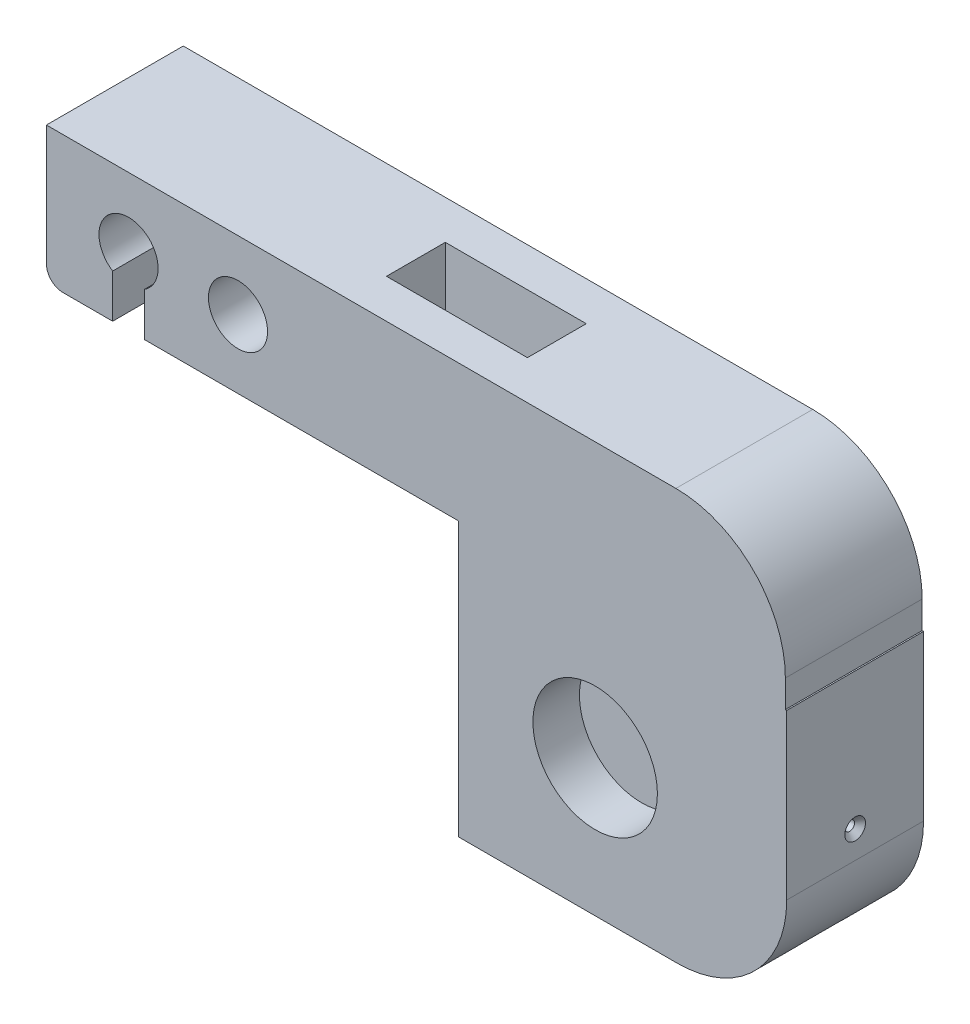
ISO-10303-21;
HEADER;
FILE_DESCRIPTION(('STEP AP214'),'2;1');
FILE_NAME('part.step','',(''),(''),'','','');
FILE_SCHEMA(('AUTOMOTIVE_DESIGN { 1 0 10303 214 1 1 1 1 }'));
ENDSEC;
DATA;
#1=APPLICATION_CONTEXT('core data for automotive mechanical design processes');
#2=APPLICATION_PROTOCOL_DEFINITION('international standard','automotive_design',2000,#1);
#3=PRODUCT_CONTEXT('',#1,'mechanical');
#4=PRODUCT('Part','Part','',(#3));
#5=PRODUCT_RELATED_PRODUCT_CATEGORY('part','',(#4));
#6=PRODUCT_DEFINITION_FORMATION('','',#4);
#7=PRODUCT_DEFINITION_CONTEXT('part definition',#1,'design');
#8=PRODUCT_DEFINITION('design','',#6,#7);
#9=PRODUCT_DEFINITION_SHAPE('','',#8);
#10=(LENGTH_UNIT() NAMED_UNIT(*) SI_UNIT(.MILLI.,.METRE.));
#11=(NAMED_UNIT(*) PLANE_ANGLE_UNIT() SI_UNIT($,.RADIAN.));
#12=(NAMED_UNIT(*) SI_UNIT($,.STERADIAN.) SOLID_ANGLE_UNIT());
#13=UNCERTAINTY_MEASURE_WITH_UNIT(LENGTH_MEASURE(1.E-05),#10,'distance_accuracy_value','');
#14=(GEOMETRIC_REPRESENTATION_CONTEXT(3) GLOBAL_UNCERTAINTY_ASSIGNED_CONTEXT((#13)) GLOBAL_UNIT_ASSIGNED_CONTEXT((#10,
#11,#12)) REPRESENTATION_CONTEXT('',''));
#15=CARTESIAN_POINT('',(0.,0.,0.));
#16=DIRECTION('',(0.,0.,1.));
#17=DIRECTION('',(1.,0.,0.));
#18=AXIS2_PLACEMENT_3D('',#15,#16,#17);
#19=CARTESIAN_POINT('',(0.,-50.,0.));
#20=DIRECTION('',(0.,-1.,0.));
#21=DIRECTION('',(1.,0.,0.));
#22=AXIS2_PLACEMENT_3D('',#19,#20,#21);
#23=PLANE('',#22);
#24=DIRECTION('',(1.,0.,0.));
#25=VECTOR('',#24,1.);
#26=CARTESIAN_POINT('',(-59.75,-50.,0.));
#27=LINE('',#26,#25);
#28=CARTESIAN_POINT('',(-59.75,-50.,0.));
#29=VERTEX_POINT('',#28);
#30=CARTESIAN_POINT('',(-19.75,-50.,0.));
#31=VERTEX_POINT('',#30);
#32=EDGE_CURVE('E278',#29,#31,#27,.T.);
#33=ORIENTED_EDGE('',*,*,#32,.T.);
#34=DIRECTION('',(0.,0.,1.));
#35=VECTOR('',#34,1.);
#36=CARTESIAN_POINT('',(-19.75,-50.,25.));
#37=LINE('',#36,#35);
#38=CARTESIAN_POINT('',(-19.75,-50.,8.5));
#39=VERTEX_POINT('',#38);
#40=EDGE_CURVE('E443',#31,#39,#37,.T.);
#41=ORIENTED_EDGE('',*,*,#40,.T.);
#42=DIRECTION('',(1.,0.,0.));
#43=VECTOR('',#42,1.);
#44=CARTESIAN_POINT('',(-59.75,-50.,8.5));
#45=LINE('',#44,#43);
#46=CARTESIAN_POINT('',(-54.25,-50.,8.5));
#47=VERTEX_POINT('',#46);
#48=EDGE_CURVE('E587',#47,#39,#45,.T.);
#49=ORIENTED_EDGE('',*,*,#48,.F.);
#50=DIRECTION('',(0.,0.,1.));
#51=VECTOR('',#50,1.);
#52=CARTESIAN_POINT('',(-54.25,-50.,17.875));
#53=LINE('',#52,#51);
#54=CARTESIAN_POINT('',(-54.25,-50.,7.125));
#55=VERTEX_POINT('',#54);
#56=EDGE_CURVE('E261',#55,#47,#53,.T.);
#57=ORIENTED_EDGE('',*,*,#56,.F.);
#58=DIRECTION('',(1.,0.,0.));
#59=VECTOR('',#58,1.);
#60=CARTESIAN_POINT('',(-59.75,-50.,7.125));
#61=LINE('',#60,#59);
#62=CARTESIAN_POINT('',(-59.75,-50.,7.125));
#63=VERTEX_POINT('',#62);
#64=EDGE_CURVE('E243',#63,#55,#61,.T.);
#65=ORIENTED_EDGE('',*,*,#64,.F.);
#66=DIRECTION('',(0.,0.,-1.));
#67=VECTOR('',#66,1.);
#68=CARTESIAN_POINT('',(-59.75,-50.,25.));
#69=LINE('',#68,#67);
#70=EDGE_CURVE('E258',#63,#29,#69,.T.);
#71=ORIENTED_EDGE('',*,*,#70,.T.);
#72=EDGE_LOOP('',(#33,#41,#49,#57,#65,#71));
#73=FACE_BOUND('',#72,.T.);
#74=ADVANCED_FACE('F67',(#73),#23,.T.);
#75=CARTESIAN_POINT('',(-59.75,-22.9265130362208,7.125));
#76=DIRECTION('',(1.,0.,0.));
#77=DIRECTION('',(0.,1.,0.));
#78=AXIS2_PLACEMENT_3D('',#75,#76,#77);
#79=PLANE('',#78);
#80=DIRECTION('',(0.,0.,-1.));
#81=VECTOR('',#80,1.);
#82=CARTESIAN_POINT('',(-59.75,0.,25.));
#83=LINE('',#82,#81);
#84=CARTESIAN_POINT('',(-59.75,0.,25.));
#85=VERTEX_POINT('',#84);
#86=CARTESIAN_POINT('',(-59.75,0.,17.875));
#87=VERTEX_POINT('',#86);
#88=EDGE_CURVE('E292',#85,#87,#83,.T.);
#89=ORIENTED_EDGE('',*,*,#88,.T.);
#90=DIRECTION('',(0.,-1.,0.));
#91=VECTOR('',#90,1.);
#92=CARTESIAN_POINT('',(-59.75,25.,17.875));
#93=LINE('',#92,#91);
#94=CARTESIAN_POINT('',(-59.75,-50.,17.875));
#95=VERTEX_POINT('',#94);
#96=EDGE_CURVE('E647',#87,#95,#93,.T.);
#97=ORIENTED_EDGE('',*,*,#96,.T.);
#98=CARTESIAN_POINT('',(-59.75,-50.,25.));
#99=VERTEX_POINT('',#98);
#100=EDGE_CURVE('E271',#99,#95,#69,.T.);
#101=ORIENTED_EDGE('',*,*,#100,.F.);
#102=DIRECTION('',(0.,1.,0.));
#103=VECTOR('',#102,1.);
#104=CARTESIAN_POINT('',(-59.75,-50.,25.));
#105=LINE('',#104,#103);
#106=EDGE_CURVE('E291',#99,#85,#105,.T.);
#107=ORIENTED_EDGE('',*,*,#106,.T.);
#108=EDGE_LOOP('',(#89,#97,#101,#107));
#109=FACE_BOUND('',#108,.T.);
#110=ADVANCED_FACE('F694',(#109),#79,.F.);
#111=CARTESIAN_POINT('',(0.,0.,25.));
#112=DIRECTION('',(0.,-1.,0.));
#113=DIRECTION('',(1.,0.,0.));
#114=AXIS2_PLACEMENT_3D('',#111,#112,#113);
#115=PLANE('',#114);
#116=DIRECTION('',(-1.,0.,0.));
#117=VECTOR('',#116,1.);
#118=CARTESIAN_POINT('',(0.,0.,0.));
#119=LINE('',#118,#117);
#120=CARTESIAN_POINT('',(-59.75,0.,0.));
#121=VERTEX_POINT('',#120);
#122=CARTESIAN_POINT('',(-117.1,0.,0.));
#123=VERTEX_POINT('',#122);
#124=EDGE_CURVE('E386',#121,#123,#119,.T.);
#125=ORIENTED_EDGE('',*,*,#124,.F.);
#126=CARTESIAN_POINT('',(-59.75,0.,7.125));
#127=VERTEX_POINT('',#126);
#128=EDGE_CURVE('E297',#127,#121,#83,.T.);
#129=ORIENTED_EDGE('',*,*,#128,.F.);
#130=DIRECTION('',(-1.,0.,0.));
#131=VECTOR('',#130,1.);
#132=CARTESIAN_POINT('',(-80.,0.,7.125));
#133=LINE('',#132,#131);
#134=CARTESIAN_POINT('',(-80.,0.,7.125));
#135=VERTEX_POINT('',#134);
#136=EDGE_CURVE('E247',#127,#135,#133,.T.);
#137=ORIENTED_EDGE('',*,*,#136,.T.);
#138=DIRECTION('',(0.,0.,1.));
#139=VECTOR('',#138,1.);
#140=CARTESIAN_POINT('',(-80.,0.,7.125));
#141=LINE('',#140,#139);
#142=CARTESIAN_POINT('',(-80.,0.,17.875));
#143=VERTEX_POINT('',#142);
#144=EDGE_CURVE('E329',#135,#143,#141,.T.);
#145=ORIENTED_EDGE('',*,*,#144,.T.);
#146=DIRECTION('',(1.,0.,0.));
#147=VECTOR('',#146,1.);
#148=CARTESIAN_POINT('',(-80.,0.,17.875));
#149=LINE('',#148,#147);
#150=EDGE_CURVE('E319',#143,#87,#149,.T.);
#151=ORIENTED_EDGE('',*,*,#150,.T.);
#152=ORIENTED_EDGE('',*,*,#88,.F.);
#153=DIRECTION('',(-1.,0.,0.));
#154=VECTOR('',#153,1.);
#155=CARTESIAN_POINT('',(0.,0.,25.));
#156=LINE('',#155,#154);
#157=CARTESIAN_POINT('',(-117.1,0.,25.));
#158=VERTEX_POINT('',#157);
#159=EDGE_CURVE('E356',#85,#158,#156,.T.);
#160=ORIENTED_EDGE('',*,*,#159,.T.);
#161=DIRECTION('',(0.,0.,-1.));
#162=VECTOR('',#161,1.);
#163=CARTESIAN_POINT('',(-117.1,0.,25.));
#164=LINE('',#163,#162);
#165=EDGE_CURVE('E416',#158,#123,#164,.T.);
#166=ORIENTED_EDGE('',*,*,#165,.T.);
#167=EDGE_LOOP('',(#125,#129,#137,#145,#151,#152,#160,#166));
#168=FACE_BOUND('',#167,.T.);
#169=ADVANCED_FACE('F679',(#168),#115,.T.);
#170=CARTESIAN_POINT('',(-120.,12.5,25.));
#171=DIRECTION('',(0.,0.,-1.));
#172=DIRECTION('',(-1.,0.,0.));
#173=AXIS2_PLACEMENT_3D('',#170,#171,#172);
#174=CYLINDRICAL_SURFACE('',#173,5.39999999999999);
#175=CARTESIAN_POINT('',(-120.,12.5,0.));
#176=DIRECTION('',(0.,0.,1.));
#177=DIRECTION('',(1.,0.,0.));
#178=AXIS2_PLACEMENT_3D('',#175,#176,#177);
#179=CIRCLE('',#178,5.39999999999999);
#180=CARTESIAN_POINT('',(-117.1,7.94478321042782,0.));
#181=VERTEX_POINT('',#180);
#182=CARTESIAN_POINT('',(-122.9,7.94478321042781,0.));
#183=VERTEX_POINT('',#182);
#184=EDGE_CURVE('E378',#181,#183,#179,.T.);
#185=ORIENTED_EDGE('',*,*,#184,.F.);
#186=DIRECTION('',(0.,0.,-1.));
#187=VECTOR('',#186,1.);
#188=CARTESIAN_POINT('',(-117.1,7.94478321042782,25.));
#189=LINE('',#188,#187);
#190=CARTESIAN_POINT('',(-117.1,7.94478321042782,25.));
#191=VERTEX_POINT('',#190);
#192=EDGE_CURVE('E420',#191,#181,#189,.T.);
#193=ORIENTED_EDGE('',*,*,#192,.F.);
#194=CARTESIAN_POINT('',(-120.,12.5,25.));
#195=DIRECTION('',(0.,0.,1.));
#196=DIRECTION('',(1.,0.,0.));
#197=AXIS2_PLACEMENT_3D('',#194,#195,#196);
#198=CIRCLE('',#197,5.39999999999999);
#199=CARTESIAN_POINT('',(-122.9,7.94478321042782,25.));
#200=VERTEX_POINT('',#199);
#201=EDGE_CURVE('E347',#191,#200,#198,.T.);
#202=ORIENTED_EDGE('',*,*,#201,.T.);
#203=DIRECTION('',(0.,0.,-1.));
#204=VECTOR('',#203,1.);
#205=CARTESIAN_POINT('',(-122.9,7.94478321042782,25.));
#206=LINE('',#205,#204);
#207=EDGE_CURVE('E374',#200,#183,#206,.T.);
#208=ORIENTED_EDGE('',*,*,#207,.T.);
#209=EDGE_LOOP('',(#185,#193,#202,#208));
#210=FACE_BOUND('',#209,.T.);
#211=ADVANCED_FACE('F687',(#210),#174,.F.);
#212=CARTESIAN_POINT('',(-117.1,0.,25.));
#213=DIRECTION('',(-1.,0.,0.));
#214=DIRECTION('',(0.,0.,1.));
#215=AXIS2_PLACEMENT_3D('',#212,#213,#214);
#216=PLANE('',#215);
#217=DIRECTION('',(0.,1.,0.));
#218=VECTOR('',#217,1.);
#219=CARTESIAN_POINT('',(-117.1,0.,0.));
#220=LINE('',#219,#218);
#221=EDGE_CURVE('E382',#123,#181,#220,.T.);
#222=ORIENTED_EDGE('',*,*,#221,.F.);
#223=ORIENTED_EDGE('',*,*,#165,.F.);
#224=DIRECTION('',(0.,1.,0.));
#225=VECTOR('',#224,1.);
#226=CARTESIAN_POINT('',(-117.1,0.,25.));
#227=LINE('',#226,#225);
#228=EDGE_CURVE('E352',#158,#191,#227,.T.);
#229=ORIENTED_EDGE('',*,*,#228,.T.);
#230=ORIENTED_EDGE('',*,*,#192,.T.);
#231=EDGE_LOOP('',(#222,#223,#229,#230));
#232=FACE_BOUND('',#231,.T.);
#233=ADVANCED_FACE('F683',(#232),#216,.T.);
#234=CARTESIAN_POINT('',(0.,0.,25.));
#235=DIRECTION('',(-1.,0.,0.));
#236=DIRECTION('',(0.,0.,1.));
#237=AXIS2_PLACEMENT_3D('',#234,#235,#236);
#238=PLANE('',#237);
#239=DIRECTION('',(0.,1.,0.));
#240=VECTOR('',#239,1.);
#241=CARTESIAN_POINT('',(0.,0.,0.));
#242=LINE('',#241,#240);
#243=CARTESIAN_POINT('',(0.,0.,0.));
#244=VERTEX_POINT('',#243);
#245=CARTESIAN_POINT('',(0.,5.,0.));
#246=VERTEX_POINT('',#245);
#247=EDGE_CURVE('E389',#244,#246,#242,.T.);
#248=ORIENTED_EDGE('',*,*,#247,.T.);
#249=DIRECTION('',(0.,0.,-1.));
#250=VECTOR('',#249,1.);
#251=CARTESIAN_POINT('',(0.,5.,25.));
#252=LINE('',#251,#250);
#253=CARTESIAN_POINT('',(0.,5.,25.));
#254=VERTEX_POINT('',#253);
#255=EDGE_CURVE('E475',#246,#254,#252,.F.);
#256=ORIENTED_EDGE('',*,*,#255,.T.);
#257=DIRECTION('',(0.,1.,0.));
#258=VECTOR('',#257,1.);
#259=CARTESIAN_POINT('',(0.,0.,25.));
#260=LINE('',#259,#258);
#261=CARTESIAN_POINT('',(0.,0.,25.));
#262=VERTEX_POINT('',#261);
#263=EDGE_CURVE('E359',#262,#254,#260,.T.);
#264=ORIENTED_EDGE('',*,*,#263,.F.);
#265=DIRECTION('',(0.,0.,-1.));
#266=VECTOR('',#265,1.);
#267=CARTESIAN_POINT('',(0.,0.,25.));
#268=LINE('',#267,#266);
#269=EDGE_CURVE('E413',#262,#244,#268,.T.);
#270=ORIENTED_EDGE('',*,*,#269,.T.);
#271=EDGE_LOOP('',(#248,#256,#264,#270));
#272=FACE_BOUND('',#271,.T.);
#273=ADVANCED_FACE('F569',(#272),#238,.F.);
#274=CARTESIAN_POINT('',(0.,25.,25.));
#275=DIRECTION('',(0.,-1.,0.));
#276=DIRECTION('',(1.,0.,0.));
#277=AXIS2_PLACEMENT_3D('',#274,#275,#276);
#278=PLANE('',#277);
#279=DIRECTION('',(0.,0.,1.));
#280=VECTOR('',#279,1.);
#281=CARTESIAN_POINT('',(-54.25,25.,17.875));
#282=LINE('',#281,#280);
#283=CARTESIAN_POINT('',(-54.25,25.,7.125));
#284=VERTEX_POINT('',#283);
#285=CARTESIAN_POINT('',(-54.25,25.,17.875));
#286=VERTEX_POINT('',#285);
#287=EDGE_CURVE('E254',#284,#286,#282,.T.);
#288=ORIENTED_EDGE('',*,*,#287,.T.);
#289=DIRECTION('',(1.,0.,0.));
#290=VECTOR('',#289,1.);
#291=CARTESIAN_POINT('',(-80.,25.,17.875));
#292=LINE('',#291,#290);
#293=CARTESIAN_POINT('',(-80.,25.,17.875));
#294=VERTEX_POINT('',#293);
#295=EDGE_CURVE('E320',#294,#286,#292,.T.);
#296=ORIENTED_EDGE('',*,*,#295,.F.);
#297=DIRECTION('',(0.,0.,1.));
#298=VECTOR('',#297,1.);
#299=CARTESIAN_POINT('',(-80.,25.,7.125));
#300=LINE('',#299,#298);
#301=CARTESIAN_POINT('',(-80.,25.,7.125));
#302=VERTEX_POINT('',#301);
#303=EDGE_CURVE('E315',#302,#294,#300,.T.);
#304=ORIENTED_EDGE('',*,*,#303,.F.);
#305=DIRECTION('',(-1.,0.,0.));
#306=VECTOR('',#305,1.);
#307=CARTESIAN_POINT('',(-80.,25.,7.125));
#308=LINE('',#307,#306);
#309=EDGE_CURVE('E316',#284,#302,#308,.T.);
#310=ORIENTED_EDGE('',*,*,#309,.F.);
#311=EDGE_LOOP('',(#288,#296,#304,#310));
#312=FACE_BOUND('',#311,.T.);
#313=DIRECTION('',(-1.,0.,0.));
#314=VECTOR('',#313,1.);
#315=CARTESIAN_POINT('',(0.,25.,25.));
#316=LINE('',#315,#314);
#317=CARTESIAN_POINT('',(-20.,25.,25.));
#318=VERTEX_POINT('',#317);
#319=CARTESIAN_POINT('',(-135.,25.,25.));
#320=VERTEX_POINT('',#319);
#321=EDGE_CURVE('E364',#318,#320,#316,.T.);
#322=ORIENTED_EDGE('',*,*,#321,.F.);
#323=DIRECTION('',(0.,0.,-1.));
#324=VECTOR('',#323,1.);
#325=CARTESIAN_POINT('',(-20.,25.,25.));
#326=LINE('',#325,#324);
#327=CARTESIAN_POINT('',(-20.,25.,0.));
#328=VERTEX_POINT('',#327);
#329=EDGE_CURVE('E471',#318,#328,#326,.T.);
#330=ORIENTED_EDGE('',*,*,#329,.T.);
#331=DIRECTION('',(-1.,0.,0.));
#332=VECTOR('',#331,1.);
#333=CARTESIAN_POINT('',(0.,25.,0.));
#334=LINE('',#333,#332);
#335=CARTESIAN_POINT('',(-135.,25.,0.));
#336=VERTEX_POINT('',#335);
#337=EDGE_CURVE('E394',#328,#336,#334,.T.);
#338=ORIENTED_EDGE('',*,*,#337,.T.);
#339=DIRECTION('',(0.,0.,-1.));
#340=VECTOR('',#339,1.);
#341=CARTESIAN_POINT('',(-135.,25.,25.));
#342=LINE('',#341,#340);
#343=EDGE_CURVE('E409',#320,#336,#342,.T.);
#344=ORIENTED_EDGE('',*,*,#343,.F.);
#345=EDGE_LOOP('',(#322,#330,#338,#344));
#346=FACE_BOUND('',#345,.T.);
#347=ADVANCED_FACE('F561',(#312,#346),#278,.F.);
#348=CARTESIAN_POINT('',(-135.,0.,25.));
#349=DIRECTION('',(-1.,0.,0.));
#350=DIRECTION('',(0.,0.,1.));
#351=AXIS2_PLACEMENT_3D('',#348,#349,#350);
#352=PLANE('',#351);
#353=DIRECTION('',(0.,1.,0.));
#354=VECTOR('',#353,1.);
#355=CARTESIAN_POINT('',(-135.,0.,0.));
#356=LINE('',#355,#354);
#357=CARTESIAN_POINT('',(-135.,2.99999999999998,0.));
#358=VERTEX_POINT('',#357);
#359=EDGE_CURVE('E398',#358,#336,#356,.T.);
#360=ORIENTED_EDGE('',*,*,#359,.F.);
#361=DIRECTION('',(0.,0.,-1.));
#362=VECTOR('',#361,1.);
#363=CARTESIAN_POINT('',(-135.,2.99999999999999,25.));
#364=LINE('',#363,#362);
#365=CARTESIAN_POINT('',(-135.,2.99999999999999,25.));
#366=VERTEX_POINT('',#365);
#367=EDGE_CURVE('E76',#358,#366,#364,.F.);
#368=ORIENTED_EDGE('',*,*,#367,.T.);
#369=DIRECTION('',(0.,1.,0.));
#370=VECTOR('',#369,1.);
#371=CARTESIAN_POINT('',(-135.,0.,25.));
#372=LINE('',#371,#370);
#373=EDGE_CURVE('E368',#366,#320,#372,.T.);
#374=ORIENTED_EDGE('',*,*,#373,.T.);
#375=ORIENTED_EDGE('',*,*,#343,.T.);
#376=EDGE_LOOP('',(#360,#368,#374,#375));
#377=FACE_BOUND('',#376,.T.);
#378=ADVANCED_FACE('F559',(#377),#352,.T.);
#379=CARTESIAN_POINT('',(-122.9,0.,25.));
#380=VERTEX_POINT('',#379);
#381=CARTESIAN_POINT('',(-132.,0.,25.));
#382=VERTEX_POINT('',#381);
#383=EDGE_CURVE('E360',#380,#382,#156,.T.);
#384=ORIENTED_EDGE('',*,*,#383,.T.);
#385=DIRECTION('',(0.,0.,-1.));
#386=VECTOR('',#385,1.);
#387=CARTESIAN_POINT('',(-132.,0.,25.));
#388=LINE('',#387,#386);
#389=CARTESIAN_POINT('',(-132.,0.,0.));
#390=VERTEX_POINT('',#389);
#391=EDGE_CURVE('E478',#382,#390,#388,.T.);
#392=ORIENTED_EDGE('',*,*,#391,.T.);
#393=CARTESIAN_POINT('',(-122.9,0.,0.));
#394=VERTEX_POINT('',#393);
#395=EDGE_CURVE('E390',#394,#390,#119,.T.);
#396=ORIENTED_EDGE('',*,*,#395,.F.);
#397=DIRECTION('',(0.,0.,-1.));
#398=VECTOR('',#397,1.);
#399=CARTESIAN_POINT('',(-122.9,0.,25.));
#400=LINE('',#399,#398);
#401=EDGE_CURVE('E406',#380,#394,#400,.T.);
#402=ORIENTED_EDGE('',*,*,#401,.F.);
#403=EDGE_LOOP('',(#384,#392,#396,#402));
#404=FACE_BOUND('',#403,.T.);
#405=ADVANCED_FACE('F549',(#404),#115,.T.);
#406=CARTESIAN_POINT('',(-100.,12.5,25.));
#407=DIRECTION('',(0.,0.,-1.));
#408=DIRECTION('',(-1.,0.,0.));
#409=AXIS2_PLACEMENT_3D('',#406,#407,#408);
#410=CYLINDRICAL_SURFACE('',#409,5.39999999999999);
#411=CARTESIAN_POINT('',(-100.,12.5,25.));
#412=DIRECTION('',(0.,0.,1.));
#413=DIRECTION('',(1.,0.,0.));
#414=AXIS2_PLACEMENT_3D('',#411,#412,#413);
#415=CIRCLE('',#414,5.39999999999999);
#416=CARTESIAN_POINT('',(-105.4,12.5,25.));
#417=VERTEX_POINT('',#416);
#418=EDGE_CURVE('E343',#417,#417,#415,.T.);
#419=CARTESIAN_POINT('',(-99.9999999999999,12.5,0.));
#420=DIRECTION('',(0.,0.,1.));
#421=DIRECTION('',(1.,0.,0.));
#422=AXIS2_PLACEMENT_3D('',#419,#420,#421);
#423=CIRCLE('',#422,5.39999999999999);
#424=CARTESIAN_POINT('',(-105.4,12.5,0.));
#425=VERTEX_POINT('',#424);
#426=EDGE_CURVE('E342',#425,#425,#423,.T.);
#427=CARTESIAN_POINT('',(-105.4,12.5,25.));
#428=CARTESIAN_POINT('',(-105.4,12.5,24.7395833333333));
#429=CARTESIAN_POINT('',(-105.4,12.5,24.4791666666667));
#430=CARTESIAN_POINT('',(-105.4,12.5,23.9583333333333));
#431=CARTESIAN_POINT('',(-105.4,12.5,23.6979166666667));
#432=CARTESIAN_POINT('',(-105.4,12.5,23.1770833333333));
#433=CARTESIAN_POINT('',(-105.4,12.5,22.9166666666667));
#434=CARTESIAN_POINT('',(-105.4,12.5,22.3958333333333));
#435=CARTESIAN_POINT('',(-105.4,12.5,22.1354166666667));
#436=CARTESIAN_POINT('',(-105.4,12.5,21.6145833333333));
#437=CARTESIAN_POINT('',(-105.4,12.5,21.3541666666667));
#438=CARTESIAN_POINT('',(-105.4,12.5,20.8333333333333));
#439=CARTESIAN_POINT('',(-105.4,12.5,20.5729166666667));
#440=CARTESIAN_POINT('',(-105.4,12.5,20.0520833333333));
#441=CARTESIAN_POINT('',(-105.4,12.5,19.7916666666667));
#442=CARTESIAN_POINT('',(-105.4,12.5,19.2708333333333));
#443=CARTESIAN_POINT('',(-105.4,12.5,19.0104166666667));
#444=CARTESIAN_POINT('',(-105.4,12.5,18.4895833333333));
#445=CARTESIAN_POINT('',(-105.4,12.5,18.2291666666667));
#446=CARTESIAN_POINT('',(-105.4,12.5,17.7083333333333));
#447=CARTESIAN_POINT('',(-105.4,12.5,17.4479166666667));
#448=CARTESIAN_POINT('',(-105.4,12.5,16.9270833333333));
#449=CARTESIAN_POINT('',(-105.4,12.5,16.6666666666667));
#450=CARTESIAN_POINT('',(-105.4,12.5,16.1458333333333));
#451=CARTESIAN_POINT('',(-105.4,12.5,15.8854166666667));
#452=CARTESIAN_POINT('',(-105.4,12.5,15.3645833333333));
#453=CARTESIAN_POINT('',(-105.4,12.5,15.1041666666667));
#454=CARTESIAN_POINT('',(-105.4,12.5,14.5833333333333));
#455=CARTESIAN_POINT('',(-105.4,12.5,14.3229166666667));
#456=CARTESIAN_POINT('',(-105.4,12.5,13.8020833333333));
#457=CARTESIAN_POINT('',(-105.4,12.5,13.5416666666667));
#458=CARTESIAN_POINT('',(-105.4,12.5,13.0208333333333));
#459=CARTESIAN_POINT('',(-105.4,12.5,12.7604166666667));
#460=CARTESIAN_POINT('',(-105.4,12.5,12.2395833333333));
#461=CARTESIAN_POINT('',(-105.4,12.5,11.9791666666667));
#462=CARTESIAN_POINT('',(-105.4,12.5,11.4583333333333));
#463=CARTESIAN_POINT('',(-105.4,12.5,11.1979166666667));
#464=CARTESIAN_POINT('',(-105.4,12.5,10.6770833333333));
#465=CARTESIAN_POINT('',(-105.4,12.5,10.4166666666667));
#466=CARTESIAN_POINT('',(-105.4,12.5,9.89583333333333));
#467=CARTESIAN_POINT('',(-105.4,12.5,9.63541666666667));
#468=CARTESIAN_POINT('',(-105.4,12.5,9.11458333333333));
#469=CARTESIAN_POINT('',(-105.4,12.5,8.85416666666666));
#470=CARTESIAN_POINT('',(-105.4,12.5,8.33333333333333));
#471=CARTESIAN_POINT('',(-105.4,12.5,8.07291666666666));
#472=CARTESIAN_POINT('',(-105.4,12.5,7.55208333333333));
#473=CARTESIAN_POINT('',(-105.4,12.5,7.29166666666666));
#474=CARTESIAN_POINT('',(-105.4,12.5,6.77083333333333));
#475=CARTESIAN_POINT('',(-105.4,12.5,6.51041666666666));
#476=CARTESIAN_POINT('',(-105.4,12.5,5.98958333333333));
#477=CARTESIAN_POINT('',(-105.4,12.5,5.72916666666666));
#478=CARTESIAN_POINT('',(-105.4,12.5,5.20833333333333));
#479=CARTESIAN_POINT('',(-105.4,12.5,4.94791666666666));
#480=CARTESIAN_POINT('',(-105.4,12.5,4.42708333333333));
#481=CARTESIAN_POINT('',(-105.4,12.5,4.16666666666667));
#482=CARTESIAN_POINT('',(-105.4,12.5,3.64583333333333));
#483=CARTESIAN_POINT('',(-105.4,12.5,3.38541666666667));
#484=CARTESIAN_POINT('',(-105.4,12.5,2.86458333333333));
#485=CARTESIAN_POINT('',(-105.4,12.5,2.60416666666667));
#486=CARTESIAN_POINT('',(-105.4,12.5,2.08333333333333));
#487=CARTESIAN_POINT('',(-105.4,12.5,1.82291666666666));
#488=CARTESIAN_POINT('',(-105.4,12.5,1.30208333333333));
#489=CARTESIAN_POINT('',(-105.4,12.5,1.04166666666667));
#490=CARTESIAN_POINT('',(-105.4,12.5,0.520833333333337));
#491=CARTESIAN_POINT('',(-105.4,12.5,0.26041666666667));
#492=CARTESIAN_POINT('',(-105.4,12.5,0.));
#493=B_SPLINE_CURVE_WITH_KNOTS('',3,(#427,#428,#429,#430,#431,#432,#433,#434,#435,#436,#437,
#438,#439,#440,#441,#442,#443,#444,#445,#446,#447,#448,#449,#450,#451,#452,#453,#454,#455,#456,
#457,#458,#459,#460,#461,#462,#463,#464,#465,#466,#467,#468,#469,#470,#471,#472,#473,#474,#475,
#476,#477,#478,#479,#480,#481,#482,#483,#484,#485,#486,#487,#488,#489,#490,#491,#492),
.UNSPECIFIED.,.F.,.F.,(4,2,2,2,2,2,2,2,2,2,2,2,2,2,2,2,2,2,2,2,2,2,2,2,2,2,2,2,2,2,2,2,4),(0.,
0.781249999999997,1.5625,2.34375,3.125,3.90625,4.6875,5.46874999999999,6.25,7.03125,
7.81249999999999,8.59374999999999,9.37499999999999,10.15625,10.9375,11.71875,12.5,13.28125,
14.0625,14.84375,15.625,16.40625,17.1875,17.96875,18.75,19.53125,20.3125,21.09375,21.875,
22.65625,23.4375,24.21875,25.),.UNSPECIFIED.);
#494=EDGE_CURVE('BSEAM761',#417,#425,#493,.T.);
#495=ORIENTED_EDGE('',*,*,#418,.T.);
#496=ORIENTED_EDGE('',*,*,#426,.F.);
#497=ORIENTED_EDGE('',*,*,#494,.T.);
#498=ORIENTED_EDGE('',*,*,#494,.F.);
#499=EDGE_LOOP('',(#495,#497,#496,#498));
#500=FACE_BOUND('',#499,.T.);
#501=ADVANCED_FACE('F761',(#500),#410,.F.);
#502=CARTESIAN_POINT('',(-122.9,0.,25.));
#503=DIRECTION('',(-1.,0.,0.));
#504=DIRECTION('',(0.,0.,1.));
#505=AXIS2_PLACEMENT_3D('',#502,#503,#504);
#506=PLANE('',#505);
#507=DIRECTION('',(0.,1.,0.));
#508=VECTOR('',#507,1.);
#509=CARTESIAN_POINT('',(-122.9,0.,0.));
#510=LINE('',#509,#508);
#511=EDGE_CURVE('E348',#394,#183,#510,.T.);
#512=ORIENTED_EDGE('',*,*,#511,.T.);
#513=ORIENTED_EDGE('',*,*,#207,.F.);
#514=DIRECTION('',(0.,1.,0.));
#515=VECTOR('',#514,1.);
#516=CARTESIAN_POINT('',(-122.9,0.,25.));
#517=LINE('',#516,#515);
#518=EDGE_CURVE('E371',#380,#200,#517,.T.);
#519=ORIENTED_EDGE('',*,*,#518,.F.);
#520=ORIENTED_EDGE('',*,*,#401,.T.);
#521=EDGE_LOOP('',(#512,#513,#519,#520));
#522=FACE_BOUND('',#521,.T.);
#523=ADVANCED_FACE('F690',(#522),#506,.F.);
#524=CARTESIAN_POINT('',(0.,0.,25.));
#525=DIRECTION('',(0.,0.,1.));
#526=DIRECTION('',(1.,0.,0.));
#527=AXIS2_PLACEMENT_3D('',#524,#525,#526);
#528=PLANE('',#527);
#529=CARTESIAN_POINT('',(-34.75,-25.,25.));
#530=DIRECTION('',(0.,0.,1.));
#531=DIRECTION('',(1.,0.,0.));
#532=AXIS2_PLACEMENT_3D('',#529,#530,#531);
#533=CIRCLE('',#532,11.375);
#534=CARTESIAN_POINT('',(-23.375,-25.,25.));
#535=VERTEX_POINT('',#534);
#536=EDGE_CURVE('E661',#535,#535,#533,.T.);
#537=ORIENTED_EDGE('',*,*,#536,.F.);
#538=EDGE_LOOP('',(#537));
#539=FACE_BOUND('',#538,.T.);
#540=ORIENTED_EDGE('',*,*,#418,.F.);
#541=EDGE_LOOP('',(#540));
#542=FACE_BOUND('',#541,.T.);
#543=ORIENTED_EDGE('',*,*,#373,.F.);
#544=CARTESIAN_POINT('',(-132.,2.99999999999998,25.));
#545=DIRECTION('',(0.,0.,1.));
#546=DIRECTION('',(1.,0.,0.));
#547=AXIS2_PLACEMENT_3D('',#544,#545,#546);
#548=CIRCLE('',#547,3.);
#549=EDGE_CURVE('E15',#366,#382,#548,.T.);
#550=ORIENTED_EDGE('',*,*,#549,.T.);
#551=ORIENTED_EDGE('',*,*,#383,.F.);
#552=ORIENTED_EDGE('',*,*,#518,.T.);
#553=ORIENTED_EDGE('',*,*,#201,.F.);
#554=ORIENTED_EDGE('',*,*,#228,.F.);
#555=ORIENTED_EDGE('',*,*,#159,.F.);
#556=ORIENTED_EDGE('',*,*,#106,.F.);
#557=DIRECTION('',(-1.,0.,0.));
#558=VECTOR('',#557,1.);
#559=CARTESIAN_POINT('',(-59.75,-50.,25.));
#560=LINE('',#559,#558);
#561=CARTESIAN_POINT('',(-19.75,-50.,25.));
#562=VERTEX_POINT('',#561);
#563=EDGE_CURVE('E288',#562,#99,#560,.T.);
#564=ORIENTED_EDGE('',*,*,#563,.F.);
#565=CARTESIAN_POINT('',(-19.75,-30.,25.));
#566=DIRECTION('',(0.,0.,1.));
#567=DIRECTION('',(1.,0.,0.));
#568=AXIS2_PLACEMENT_3D('',#565,#566,#567);
#569=CIRCLE('',#568,20.);
#570=CARTESIAN_POINT('',(0.25,-30.,25.));
#571=VERTEX_POINT('',#570);
#572=EDGE_CURVE('E459',#562,#571,#569,.T.);
#573=ORIENTED_EDGE('',*,*,#572,.T.);
#574=DIRECTION('',(0.,1.,0.));
#575=VECTOR('',#574,1.);
#576=CARTESIAN_POINT('',(0.25,-50.,25.));
#577=LINE('',#576,#575);
#578=CARTESIAN_POINT('',(0.250000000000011,0.,25.));
#579=VERTEX_POINT('',#578);
#580=EDGE_CURVE('E307',#571,#579,#577,.T.);
#581=ORIENTED_EDGE('',*,*,#580,.T.);
#582=DIRECTION('',(-1.,0.,0.));
#583=VECTOR('',#582,1.);
#584=CARTESIAN_POINT('',(-59.75,0.,25.));
#585=LINE('',#584,#583);
#586=EDGE_CURVE('E272',#579,#262,#585,.T.);
#587=ORIENTED_EDGE('',*,*,#586,.T.);
#588=ORIENTED_EDGE('',*,*,#263,.T.);
#589=CARTESIAN_POINT('',(-20.,5.,25.));
#590=DIRECTION('',(0.,0.,1.));
#591=DIRECTION('',(1.,0.,0.));
#592=AXIS2_PLACEMENT_3D('',#589,#590,#591);
#593=CIRCLE('',#592,20.);
#594=EDGE_CURVE('E456',#254,#318,#593,.T.);
#595=ORIENTED_EDGE('',*,*,#594,.T.);
#596=ORIENTED_EDGE('',*,*,#321,.T.);
#597=EDGE_LOOP('',(#543,#550,#551,#552,#553,#554,#555,#556,#564,#573,#581,#587,#588,#595,#596));
#598=FACE_BOUND('',#597,.T.);
#599=ADVANCED_FACE('F556',(#539,#542,#598),#528,.T.);
#600=CARTESIAN_POINT('',(0.,0.,0.));
#601=DIRECTION('',(0.,0.,1.));
#602=DIRECTION('',(1.,0.,0.));
#603=AXIS2_PLACEMENT_3D('',#600,#601,#602);
#604=PLANE('',#603);
#605=CARTESIAN_POINT('',(-34.75,-25.,0.));
#606=DIRECTION('',(0.,0.,1.));
#607=DIRECTION('',(1.,0.,0.));
#608=AXIS2_PLACEMENT_3D('',#605,#606,#607);
#609=CIRCLE('',#608,11.375);
#610=CARTESIAN_POINT('',(-23.375,-25.,0.));
#611=VERTEX_POINT('',#610);
#612=EDGE_CURVE('E429',#611,#611,#609,.F.);
#613=ORIENTED_EDGE('',*,*,#612,.F.);
#614=EDGE_LOOP('',(#613));
#615=FACE_BOUND('',#614,.T.);
#616=ORIENTED_EDGE('',*,*,#426,.T.);
#617=EDGE_LOOP('',(#616));
#618=FACE_BOUND('',#617,.T.);
#619=ORIENTED_EDGE('',*,*,#395,.T.);
#620=CARTESIAN_POINT('',(-132.,2.99999999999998,0.));
#621=DIRECTION('',(0.,0.,1.));
#622=DIRECTION('',(1.,0.,0.));
#623=AXIS2_PLACEMENT_3D('',#620,#621,#622);
#624=CIRCLE('',#623,3.);
#625=EDGE_CURVE('E90',#390,#358,#624,.F.);
#626=ORIENTED_EDGE('',*,*,#625,.T.);
#627=ORIENTED_EDGE('',*,*,#359,.T.);
#628=ORIENTED_EDGE('',*,*,#337,.F.);
#629=CARTESIAN_POINT('',(-20.,5.,0.));
#630=DIRECTION('',(0.,0.,1.));
#631=DIRECTION('',(1.,0.,0.));
#632=AXIS2_PLACEMENT_3D('',#629,#630,#631);
#633=CIRCLE('',#632,20.);
#634=EDGE_CURVE('E465',#328,#246,#633,.F.);
#635=ORIENTED_EDGE('',*,*,#634,.T.);
#636=ORIENTED_EDGE('',*,*,#247,.F.);
#637=DIRECTION('',(1.,0.,0.));
#638=VECTOR('',#637,1.);
#639=CARTESIAN_POINT('',(-59.75,0.,0.));
#640=LINE('',#639,#638);
#641=CARTESIAN_POINT('',(0.250000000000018,0.,0.));
#642=VERTEX_POINT('',#641);
#643=EDGE_CURVE('E296',#244,#642,#640,.T.);
#644=ORIENTED_EDGE('',*,*,#643,.T.);
#645=DIRECTION('',(0.,1.,0.));
#646=VECTOR('',#645,1.);
#647=CARTESIAN_POINT('',(0.25,-50.,0.));
#648=LINE('',#647,#646);
#649=CARTESIAN_POINT('',(0.250000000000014,-30.,0.));
#650=VERTEX_POINT('',#649);
#651=EDGE_CURVE('E310',#650,#642,#648,.T.);
#652=ORIENTED_EDGE('',*,*,#651,.F.);
#653=CARTESIAN_POINT('',(-19.75,-30.,0.));
#654=DIRECTION('',(0.,0.,1.));
#655=DIRECTION('',(1.,0.,0.));
#656=AXIS2_PLACEMENT_3D('',#653,#654,#655);
#657=CIRCLE('',#656,20.);
#658=EDGE_CURVE('E468',#650,#31,#657,.F.);
#659=ORIENTED_EDGE('',*,*,#658,.T.);
#660=ORIENTED_EDGE('',*,*,#32,.F.);
#661=DIRECTION('',(0.,1.,0.));
#662=VECTOR('',#661,1.);
#663=CARTESIAN_POINT('',(-59.75,-50.,0.));
#664=LINE('',#663,#662);
#665=EDGE_CURVE('E269',#29,#121,#664,.T.);
#666=ORIENTED_EDGE('',*,*,#665,.T.);
#667=ORIENTED_EDGE('',*,*,#124,.T.);
#668=ORIENTED_EDGE('',*,*,#221,.T.);
#669=ORIENTED_EDGE('',*,*,#184,.T.);
#670=ORIENTED_EDGE('',*,*,#511,.F.);
#671=EDGE_LOOP('',(#619,#626,#627,#628,#635,#636,#644,#652,#659,#660,#666,#667,#668,#669,#670));
#672=FACE_BOUND('',#671,.T.);
#673=ADVANCED_FACE('F547',(#615,#618,#672),#604,.F.);
#674=CARTESIAN_POINT('',(-80.,-22.9265130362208,17.875));
#675=DIRECTION('',(0.,0.,1.));
#676=DIRECTION('',(1.,0.,0.));
#677=AXIS2_PLACEMENT_3D('',#674,#675,#676);
#678=PLANE('',#677);
#679=DIRECTION('',(0.,1.,0.));
#680=VECTOR('',#679,1.);
#681=CARTESIAN_POINT('',(-80.,-22.9265130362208,17.875));
#682=LINE('',#681,#680);
#683=EDGE_CURVE('E333',#143,#294,#682,.T.);
#684=ORIENTED_EDGE('',*,*,#683,.T.);
#685=ORIENTED_EDGE('',*,*,#295,.T.);
#686=DIRECTION('',(0.,-1.,0.));
#687=VECTOR('',#686,1.);
#688=CARTESIAN_POINT('',(-54.25,25.,17.875));
#689=LINE('',#688,#687);
#690=CARTESIAN_POINT('',(-54.25,-50.,17.875));
#691=VERTEX_POINT('',#690);
#692=EDGE_CURVE('E651',#286,#691,#689,.T.);
#693=ORIENTED_EDGE('',*,*,#692,.T.);
#694=DIRECTION('',(-1.,0.,0.));
#695=VECTOR('',#694,1.);
#696=CARTESIAN_POINT('',(-59.75,-50.,17.875));
#697=LINE('',#696,#695);
#698=EDGE_CURVE('E632',#691,#95,#697,.T.);
#699=ORIENTED_EDGE('',*,*,#698,.T.);
#700=ORIENTED_EDGE('',*,*,#96,.F.);
#701=ORIENTED_EDGE('',*,*,#150,.F.);
#702=EDGE_LOOP('',(#684,#685,#693,#699,#700,#701));
#703=FACE_BOUND('',#702,.T.);
#704=ADVANCED_FACE('F872',(#703),#678,.F.);
#705=ORIENTED_EDGE('',*,*,#70,.F.);
#706=DIRECTION('',(0.,-1.,0.));
#707=VECTOR('',#706,1.);
#708=CARTESIAN_POINT('',(-59.75,25.,7.125));
#709=LINE('',#708,#707);
#710=EDGE_CURVE('E239',#127,#63,#709,.T.);
#711=ORIENTED_EDGE('',*,*,#710,.F.);
#712=ORIENTED_EDGE('',*,*,#128,.T.);
#713=ORIENTED_EDGE('',*,*,#665,.F.);
#714=EDGE_LOOP('',(#705,#711,#712,#713));
#715=FACE_BOUND('',#714,.T.);
#716=ADVANCED_FACE('F267',(#715),#79,.F.);
#717=CARTESIAN_POINT('',(-80.,-22.9265130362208,7.125));
#718=DIRECTION('',(0.,0.,-1.));
#719=DIRECTION('',(-1.,0.,0.));
#720=AXIS2_PLACEMENT_3D('',#717,#718,#719);
#721=PLANE('',#720);
#722=ORIENTED_EDGE('',*,*,#136,.F.);
#723=ORIENTED_EDGE('',*,*,#710,.T.);
#724=ORIENTED_EDGE('',*,*,#64,.T.);
#725=DIRECTION('',(0.,-1.,0.));
#726=VECTOR('',#725,1.);
#727=CARTESIAN_POINT('',(-54.25,25.,7.125));
#728=LINE('',#727,#726);
#729=EDGE_CURVE('E253',#284,#55,#728,.T.);
#730=ORIENTED_EDGE('',*,*,#729,.F.);
#731=ORIENTED_EDGE('',*,*,#309,.T.);
#732=DIRECTION('',(0.,1.,0.));
#733=VECTOR('',#732,1.);
#734=CARTESIAN_POINT('',(-80.,-22.9265130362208,7.125));
#735=LINE('',#734,#733);
#736=EDGE_CURVE('E334',#135,#302,#735,.T.);
#737=ORIENTED_EDGE('',*,*,#736,.F.);
#738=EDGE_LOOP('',(#722,#723,#724,#730,#731,#737));
#739=FACE_BOUND('',#738,.T.);
#740=ADVANCED_FACE('F241',(#739),#721,.F.);
#741=CARTESIAN_POINT('',(-80.,-22.9265130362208,7.125));
#742=DIRECTION('',(-1.,0.,0.));
#743=DIRECTION('',(0.,-1.,0.));
#744=AXIS2_PLACEMENT_3D('',#741,#742,#743);
#745=PLANE('',#744);
#746=ORIENTED_EDGE('',*,*,#736,.T.);
#747=ORIENTED_EDGE('',*,*,#303,.T.);
#748=ORIENTED_EDGE('',*,*,#683,.F.);
#749=ORIENTED_EDGE('',*,*,#144,.F.);
#750=EDGE_LOOP('',(#746,#747,#748,#749));
#751=FACE_BOUND('',#750,.T.);
#752=ADVANCED_FACE('F705',(#751),#745,.F.);
#753=CARTESIAN_POINT('',(0.,0.,0.));
#754=DIRECTION('',(0.,-1.,0.));
#755=DIRECTION('',(1.,0.,0.));
#756=AXIS2_PLACEMENT_3D('',#753,#754,#755);
#757=PLANE('',#756);
#758=ORIENTED_EDGE('',*,*,#643,.F.);
#759=ORIENTED_EDGE('',*,*,#269,.F.);
#760=ORIENTED_EDGE('',*,*,#586,.F.);
#761=DIRECTION('',(0.,0.,1.));
#762=VECTOR('',#761,1.);
#763=CARTESIAN_POINT('',(0.250000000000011,0.,25.));
#764=LINE('',#763,#762);
#765=EDGE_CURVE('E280',#642,#579,#764,.T.);
#766=ORIENTED_EDGE('',*,*,#765,.F.);
#767=EDGE_LOOP('',(#758,#759,#760,#766));
#768=FACE_BOUND('',#767,.T.);
#769=ADVANCED_FACE('F575',(#768),#757,.F.);
#770=CARTESIAN_POINT('',(0.25,-50.,25.));
#771=DIRECTION('',(-1.,0.,0.));
#772=DIRECTION('',(0.,0.,1.));
#773=AXIS2_PLACEMENT_3D('',#770,#771,#772);
#774=PLANE('',#773);
#775=CARTESIAN_POINT('',(0.249999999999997,-25.,12.5));
#776=DIRECTION('',(-1.,0.,0.));
#777=DIRECTION('',(0.,0.,1.));
#778=AXIS2_PLACEMENT_3D('',#775,#776,#777);
#779=CIRCLE('',#778,1.89000000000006);
#780=CARTESIAN_POINT('',(0.249999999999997,-25.,10.6099999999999));
#781=VERTEX_POINT('',#780);
#782=EDGE_CURVE('E436',#781,#781,#779,.T.);
#783=ORIENTED_EDGE('',*,*,#782,.T.);
#784=EDGE_LOOP('',(#783));
#785=FACE_BOUND('',#784,.T.);
#786=ORIENTED_EDGE('',*,*,#580,.F.);
#787=DIRECTION('',(0.,0.,1.));
#788=VECTOR('',#787,1.);
#789=CARTESIAN_POINT('',(0.250000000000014,-30.,0.));
#790=LINE('',#789,#788);
#791=EDGE_CURVE('E462',#571,#650,#790,.F.);
#792=ORIENTED_EDGE('',*,*,#791,.T.);
#793=ORIENTED_EDGE('',*,*,#651,.T.);
#794=ORIENTED_EDGE('',*,*,#765,.T.);
#795=EDGE_LOOP('',(#786,#792,#793,#794));
#796=FACE_BOUND('',#795,.T.);
#797=ADVANCED_FACE('F696',(#785,#796),#774,.F.);
#798=DIRECTION('',(-1.,0.,0.));
#799=VECTOR('',#798,1.);
#800=CARTESIAN_POINT('',(-59.75,-50.,16.5));
#801=LINE('',#800,#799);
#802=CARTESIAN_POINT('',(-19.75,-50.,16.5));
#803=VERTEX_POINT('',#802);
#804=CARTESIAN_POINT('',(-54.25,-50.,16.5));
#805=VERTEX_POINT('',#804);
#806=EDGE_CURVE('E596',#803,#805,#801,.T.);
#807=ORIENTED_EDGE('',*,*,#806,.F.);
#808=DIRECTION('',(0.,0.,1.));
#809=VECTOR('',#808,1.);
#810=CARTESIAN_POINT('',(-19.75,-50.,25.));
#811=LINE('',#810,#809);
#812=EDGE_CURVE('E440',#803,#562,#811,.T.);
#813=ORIENTED_EDGE('',*,*,#812,.T.);
#814=ORIENTED_EDGE('',*,*,#563,.T.);
#815=ORIENTED_EDGE('',*,*,#100,.T.);
#816=ORIENTED_EDGE('',*,*,#698,.F.);
#817=EDGE_CURVE('E263',#805,#691,#53,.T.);
#818=ORIENTED_EDGE('',*,*,#817,.F.);
#819=EDGE_LOOP('',(#807,#813,#814,#815,#816,#818));
#820=FACE_BOUND('',#819,.T.);
#821=ADVANCED_FACE('F629',(#820),#23,.T.);
#822=CARTESIAN_POINT('',(-59.75,55.578772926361,16.5));
#823=DIRECTION('',(0.,0.,1.));
#824=DIRECTION('',(1.,0.,0.));
#825=AXIS2_PLACEMENT_3D('',#822,#823,#824);
#826=PLANE('',#825);
#827=CARTESIAN_POINT('',(-34.75,-25.,16.5));
#828=DIRECTION('',(0.,0.,1.));
#829=DIRECTION('',(1.,0.,0.));
#830=AXIS2_PLACEMENT_3D('',#827,#828,#829);
#831=CIRCLE('',#830,11.375);
#832=CARTESIAN_POINT('',(-23.375,-25.,16.5));
#833=VERTEX_POINT('',#832);
#834=EDGE_CURVE('E428',#833,#833,#831,.T.);
#835=ORIENTED_EDGE('',*,*,#834,.T.);
#836=EDGE_LOOP('',(#835));
#837=FACE_BOUND('',#836,.T.);
#838=DIRECTION('',(0.,-1.,0.));
#839=VECTOR('',#838,1.);
#840=CARTESIAN_POINT('',(-4.75,55.578772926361,16.5));
#841=LINE('',#840,#839);
#842=CARTESIAN_POINT('',(-4.75,-1.,16.5));
#843=VERTEX_POINT('',#842);
#844=CARTESIAN_POINT('',(-4.74999999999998,-43.228756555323,16.5));
#845=VERTEX_POINT('',#844);
#846=EDGE_CURVE('E609',#843,#845,#841,.T.);
#847=ORIENTED_EDGE('',*,*,#846,.T.);
#848=CARTESIAN_POINT('',(-19.75,-30.,16.5));
#849=DIRECTION('',(0.,0.,1.));
#850=DIRECTION('',(1.,0.,0.));
#851=AXIS2_PLACEMENT_3D('',#848,#849,#850);
#852=CIRCLE('',#851,20.);
#853=EDGE_CURVE('E453',#845,#803,#852,.F.);
#854=ORIENTED_EDGE('',*,*,#853,.T.);
#855=ORIENTED_EDGE('',*,*,#806,.T.);
#856=DIRECTION('',(0.,1.,0.));
#857=VECTOR('',#856,1.);
#858=CARTESIAN_POINT('',(-54.25,55.578772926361,16.5));
#859=LINE('',#858,#857);
#860=CARTESIAN_POINT('',(-54.25,-1.00000000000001,16.5));
#861=VERTEX_POINT('',#860);
#862=EDGE_CURVE('E658',#805,#861,#859,.T.);
#863=ORIENTED_EDGE('',*,*,#862,.T.);
#864=DIRECTION('',(1.,0.,0.));
#865=VECTOR('',#864,1.);
#866=CARTESIAN_POINT('',(-59.75,-1.,16.5));
#867=LINE('',#866,#865);
#868=EDGE_CURVE('E606',#861,#843,#867,.T.);
#869=ORIENTED_EDGE('',*,*,#868,.T.);
#870=EDGE_LOOP('',(#847,#854,#855,#863,#869));
#871=FACE_BOUND('',#870,.T.);
#872=ADVANCED_FACE('F624',(#837,#871),#826,.F.);
#873=CARTESIAN_POINT('',(-4.75,55.578772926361,8.5));
#874=DIRECTION('',(1.,0.,0.));
#875=DIRECTION('',(0.,0.,-1.));
#876=AXIS2_PLACEMENT_3D('',#873,#874,#875);
#877=PLANE('',#876);
#878=CARTESIAN_POINT('',(-4.74999999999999,-25.,12.5));
#879=DIRECTION('',(1.,0.,0.));
#880=DIRECTION('',(0.,0.,-1.));
#881=AXIS2_PLACEMENT_3D('',#878,#879,#880);
#882=CIRCLE('',#881,0.89);
#883=CARTESIAN_POINT('',(-4.74999999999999,-25.,11.61));
#884=VERTEX_POINT('',#883);
#885=EDGE_CURVE('E264',#884,#884,#882,.F.);
#886=ORIENTED_EDGE('',*,*,#885,.F.);
#887=EDGE_LOOP('',(#886));
#888=FACE_BOUND('',#887,.T.);
#889=DIRECTION('',(0.,-1.,0.));
#890=VECTOR('',#889,1.);
#891=CARTESIAN_POINT('',(-4.75,55.578772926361,8.5));
#892=LINE('',#891,#890);
#893=CARTESIAN_POINT('',(-4.75,-1.00000000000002,8.5));
#894=VERTEX_POINT('',#893);
#895=CARTESIAN_POINT('',(-4.74999999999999,-43.228756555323,8.5));
#896=VERTEX_POINT('',#895);
#897=EDGE_CURVE('E601',#894,#896,#892,.T.);
#898=ORIENTED_EDGE('',*,*,#897,.T.);
#899=DIRECTION('',(0.,0.,-1.));
#900=VECTOR('',#899,1.);
#901=CARTESIAN_POINT('',(-4.74999999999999,-43.228756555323,8.5));
#902=LINE('',#901,#900);
#903=EDGE_CURVE('E450',#896,#845,#902,.F.);
#904=ORIENTED_EDGE('',*,*,#903,.T.);
#905=ORIENTED_EDGE('',*,*,#846,.F.);
#906=DIRECTION('',(0.,0.,-1.));
#907=VECTOR('',#906,1.);
#908=CARTESIAN_POINT('',(-4.75,-1.00000000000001,8.5));
#909=LINE('',#908,#907);
#910=EDGE_CURVE('E612',#843,#894,#909,.T.);
#911=ORIENTED_EDGE('',*,*,#910,.T.);
#912=EDGE_LOOP('',(#898,#904,#905,#911));
#913=FACE_BOUND('',#912,.T.);
#914=ADVANCED_FACE('F616',(#888,#913),#877,.F.);
#915=CARTESIAN_POINT('',(-59.75,55.578772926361,8.5));
#916=DIRECTION('',(0.,0.,-1.));
#917=DIRECTION('',(-1.,0.,0.));
#918=AXIS2_PLACEMENT_3D('',#915,#916,#917);
#919=PLANE('',#918);
#920=CARTESIAN_POINT('',(-34.75,-25.,8.49999999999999));
#921=DIRECTION('',(0.,0.,-1.));
#922=DIRECTION('',(-1.,0.,0.));
#923=AXIS2_PLACEMENT_3D('',#920,#921,#922);
#924=CIRCLE('',#923,11.375);
#925=CARTESIAN_POINT('',(-23.375,-25.,8.49999999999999));
#926=VERTEX_POINT('',#925);
#927=EDGE_CURVE('E424',#926,#926,#924,.T.);
#928=ORIENTED_EDGE('',*,*,#927,.T.);
#929=EDGE_LOOP('',(#928));
#930=FACE_BOUND('',#929,.T.);
#931=ORIENTED_EDGE('',*,*,#48,.T.);
#932=CARTESIAN_POINT('',(-19.75,-30.,8.49999999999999));
#933=DIRECTION('',(0.,0.,-1.));
#934=DIRECTION('',(-1.,0.,0.));
#935=AXIS2_PLACEMENT_3D('',#932,#933,#934);
#936=CIRCLE('',#935,20.);
#937=EDGE_CURVE('E447',#39,#896,#936,.F.);
#938=ORIENTED_EDGE('',*,*,#937,.T.);
#939=ORIENTED_EDGE('',*,*,#897,.F.);
#940=DIRECTION('',(-1.,0.,0.));
#941=VECTOR('',#940,1.);
#942=CARTESIAN_POINT('',(-59.75,-1.00000000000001,8.5));
#943=LINE('',#942,#941);
#944=CARTESIAN_POINT('',(-54.25,-1.00000000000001,8.5));
#945=VERTEX_POINT('',#944);
#946=EDGE_CURVE('E284',#894,#945,#943,.T.);
#947=ORIENTED_EDGE('',*,*,#946,.T.);
#948=DIRECTION('',(0.,-1.,0.));
#949=VECTOR('',#948,1.);
#950=CARTESIAN_POINT('',(-54.25,55.578772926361,8.5));
#951=LINE('',#950,#949);
#952=EDGE_CURVE('E594',#945,#47,#951,.T.);
#953=ORIENTED_EDGE('',*,*,#952,.T.);
#954=EDGE_LOOP('',(#931,#938,#939,#947,#953));
#955=FACE_BOUND('',#954,.T.);
#956=ADVANCED_FACE('F590',(#930,#955),#919,.F.);
#957=CARTESIAN_POINT('',(0.,-1.00000000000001,25.));
#958=DIRECTION('',(0.,-1.,0.));
#959=DIRECTION('',(1.,0.,0.));
#960=AXIS2_PLACEMENT_3D('',#957,#958,#959);
#961=PLANE('',#960);
#962=DIRECTION('',(0.,0.,1.));
#963=VECTOR('',#962,1.);
#964=CARTESIAN_POINT('',(-54.25,-1.00000000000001,25.));
#965=LINE('',#964,#963);
#966=EDGE_CURVE('E423',#945,#861,#965,.T.);
#967=ORIENTED_EDGE('',*,*,#966,.F.);
#968=ORIENTED_EDGE('',*,*,#946,.F.);
#969=ORIENTED_EDGE('',*,*,#910,.F.);
#970=ORIENTED_EDGE('',*,*,#868,.F.);
#971=EDGE_LOOP('',(#967,#968,#969,#970));
#972=FACE_BOUND('',#971,.T.);
#973=ADVANCED_FACE('F716',(#972),#961,.T.);
#974=CARTESIAN_POINT('',(-34.75,-25.,-32.1733585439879));
#975=DIRECTION('',(0.,0.,1.));
#976=DIRECTION('',(1.,0.,0.));
#977=AXIS2_PLACEMENT_3D('',#974,#975,#976);
#978=CYLINDRICAL_SURFACE('',#977,11.375);
#979=CARTESIAN_POINT('',(-23.375,-25.,0.));
#980=CARTESIAN_POINT('',(-23.375,-25.,0.0885416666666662));
#981=CARTESIAN_POINT('',(-23.375,-25.,0.177083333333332));
#982=CARTESIAN_POINT('',(-23.375,-25.,0.354166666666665));
#983=CARTESIAN_POINT('',(-23.375,-25.,0.442708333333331));
#984=CARTESIAN_POINT('',(-23.375,-25.,0.619791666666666));
#985=CARTESIAN_POINT('',(-23.375,-25.,0.708333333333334));
#986=CARTESIAN_POINT('',(-23.375,-25.,0.885416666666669));
#987=CARTESIAN_POINT('',(-23.375,-25.,0.973958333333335));
#988=CARTESIAN_POINT('',(-23.375,-25.,1.15104166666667));
#989=CARTESIAN_POINT('',(-23.375,-25.,1.23958333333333));
#990=CARTESIAN_POINT('',(-23.375,-25.,1.41666666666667));
#991=CARTESIAN_POINT('',(-23.375,-25.,1.50520833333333));
#992=CARTESIAN_POINT('',(-23.375,-25.,1.68229166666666));
#993=CARTESIAN_POINT('',(-23.375,-25.,1.77083333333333));
#994=CARTESIAN_POINT('',(-23.375,-25.,1.94791666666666));
#995=CARTESIAN_POINT('',(-23.375,-25.,2.03645833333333));
#996=CARTESIAN_POINT('',(-23.375,-25.,2.21354166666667));
#997=CARTESIAN_POINT('',(-23.375,-25.,2.30208333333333));
#998=CARTESIAN_POINT('',(-23.375,-25.,2.47916666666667));
#999=CARTESIAN_POINT('',(-23.375,-25.,2.56770833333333));
#1000=CARTESIAN_POINT('',(-23.375,-25.,2.74479166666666));
#1001=CARTESIAN_POINT('',(-23.375,-25.,2.83333333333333));
#1002=CARTESIAN_POINT('',(-23.375,-25.,3.01041666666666));
#1003=CARTESIAN_POINT('',(-23.375,-25.,3.09895833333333));
#1004=CARTESIAN_POINT('',(-23.375,-25.,3.27604166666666));
#1005=CARTESIAN_POINT('',(-23.375,-25.,3.36458333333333));
#1006=CARTESIAN_POINT('',(-23.375,-25.,3.54166666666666));
#1007=CARTESIAN_POINT('',(-23.375,-25.,3.63020833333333));
#1008=CARTESIAN_POINT('',(-23.375,-25.,3.80729166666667));
#1009=CARTESIAN_POINT('',(-23.375,-25.,3.89583333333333));
#1010=CARTESIAN_POINT('',(-23.375,-25.,4.07291666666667));
#1011=CARTESIAN_POINT('',(-23.375,-25.,4.16145833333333));
#1012=CARTESIAN_POINT('',(-23.375,-25.,4.33854166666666));
#1013=CARTESIAN_POINT('',(-23.375,-25.,4.42708333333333));
#1014=CARTESIAN_POINT('',(-23.375,-25.,4.60416666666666));
#1015=CARTESIAN_POINT('',(-23.375,-25.,4.69270833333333));
#1016=CARTESIAN_POINT('',(-23.375,-25.,4.86979166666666));
#1017=CARTESIAN_POINT('',(-23.375,-25.,4.95833333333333));
#1018=CARTESIAN_POINT('',(-23.375,-25.,5.13541666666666));
#1019=CARTESIAN_POINT('',(-23.375,-25.,5.22395833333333));
#1020=CARTESIAN_POINT('',(-23.375,-25.,5.40104166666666));
#1021=CARTESIAN_POINT('',(-23.375,-25.,5.48958333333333));
#1022=CARTESIAN_POINT('',(-23.375,-25.,5.66666666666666));
#1023=CARTESIAN_POINT('',(-23.375,-25.,5.75520833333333));
#1024=CARTESIAN_POINT('',(-23.375,-25.,5.93229166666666));
#1025=CARTESIAN_POINT('',(-23.375,-25.,6.02083333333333));
#1026=CARTESIAN_POINT('',(-23.375,-25.,6.19791666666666));
#1027=CARTESIAN_POINT('',(-23.375,-25.,6.28645833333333));
#1028=CARTESIAN_POINT('',(-23.375,-25.,6.46354166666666));
#1029=CARTESIAN_POINT('',(-23.375,-25.,6.55208333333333));
#1030=CARTESIAN_POINT('',(-23.375,-25.,6.72916666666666));
#1031=CARTESIAN_POINT('',(-23.375,-25.,6.81770833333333));
#1032=CARTESIAN_POINT('',(-23.375,-25.,6.99479166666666));
#1033=CARTESIAN_POINT('',(-23.375,-25.,7.08333333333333));
#1034=CARTESIAN_POINT('',(-23.375,-25.,7.26041666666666));
#1035=CARTESIAN_POINT('',(-23.375,-25.,7.34895833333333));
#1036=CARTESIAN_POINT('',(-23.375,-25.,7.52604166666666));
#1037=CARTESIAN_POINT('',(-23.375,-25.,7.61458333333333));
#1038=CARTESIAN_POINT('',(-23.375,-25.,7.79166666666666));
#1039=CARTESIAN_POINT('',(-23.375,-25.,7.88020833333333));
#1040=CARTESIAN_POINT('',(-23.375,-25.,8.05729166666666));
#1041=CARTESIAN_POINT('',(-23.375,-25.,8.14583333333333));
#1042=CARTESIAN_POINT('',(-23.375,-25.,8.32291666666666));
#1043=CARTESIAN_POINT('',(-23.375,-25.,8.41145833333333));
#1044=CARTESIAN_POINT('',(-23.375,-25.,8.49999999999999));
#1045=B_SPLINE_CURVE_WITH_KNOTS('',3,(#979,#980,#981,#982,#983,#984,#985,#986,#987,#988,#989,
#990,#991,#992,#993,#994,#995,#996,#997,#998,#999,#1000,#1001,#1002,#1003,#1004,#1005,#1006,
#1007,#1008,#1009,#1010,#1011,#1012,#1013,#1014,#1015,#1016,#1017,#1018,#1019,#1020,#1021,#1022,
#1023,#1024,#1025,#1026,#1027,#1028,#1029,#1030,#1031,#1032,#1033,#1034,#1035,#1036,#1037,#1038,
#1039,#1040,#1041,#1042,#1043,#1044),.UNSPECIFIED.,.F.,.F.,(4,2,2,2,2,2,2,2,2,2,2,2,2,2,2,2,2,2,
2,2,2,2,2,2,2,2,2,2,2,2,2,2,4),(0.,0.265624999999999,0.531249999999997,0.796875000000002,1.0625,
1.328125,1.59375,1.859375,2.125,2.390625,2.65625,2.921875,3.1875,3.45312499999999,3.71875,
3.984375,4.25,4.515625,4.78124999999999,5.04687499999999,5.3125,5.578125,5.84374999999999,
6.10937499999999,6.37499999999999,6.640625,6.90625,7.17187499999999,7.43749999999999,
7.70312499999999,7.96875,8.23437499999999,8.49999999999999),.UNSPECIFIED.);
#1046=EDGE_CURVE('BSEAM726',#611,#926,#1045,.T.);
#1047=ORIENTED_EDGE('',*,*,#612,.T.);
#1048=ORIENTED_EDGE('',*,*,#927,.F.);
#1049=ORIENTED_EDGE('',*,*,#1046,.T.);
#1050=ORIENTED_EDGE('',*,*,#1046,.F.);
#1051=EDGE_LOOP('',(#1047,#1049,#1048,#1050));
#1052=FACE_BOUND('',#1051,.T.);
#1053=ADVANCED_FACE('F726',(#1052),#978,.F.);
#1054=CARTESIAN_POINT('',(-23.375,-25.,25.));
#1055=CARTESIAN_POINT('',(-23.375,-25.,24.9114583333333));
#1056=CARTESIAN_POINT('',(-23.375,-25.,24.8229166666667));
#1057=CARTESIAN_POINT('',(-23.375,-25.,24.6458333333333));
#1058=CARTESIAN_POINT('',(-23.375,-25.,24.5572916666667));
#1059=CARTESIAN_POINT('',(-23.375,-25.,24.3802083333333));
#1060=CARTESIAN_POINT('',(-23.375,-25.,24.2916666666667));
#1061=CARTESIAN_POINT('',(-23.375,-25.,24.1145833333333));
#1062=CARTESIAN_POINT('',(-23.375,-25.,24.0260416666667));
#1063=CARTESIAN_POINT('',(-23.375,-25.,23.8489583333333));
#1064=CARTESIAN_POINT('',(-23.375,-25.,23.7604166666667));
#1065=CARTESIAN_POINT('',(-23.375,-25.,23.5833333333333));
#1066=CARTESIAN_POINT('',(-23.375,-25.,23.4947916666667));
#1067=CARTESIAN_POINT('',(-23.375,-25.,23.3177083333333));
#1068=CARTESIAN_POINT('',(-23.375,-25.,23.2291666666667));
#1069=CARTESIAN_POINT('',(-23.375,-25.,23.0520833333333));
#1070=CARTESIAN_POINT('',(-23.375,-25.,22.9635416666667));
#1071=CARTESIAN_POINT('',(-23.375,-25.,22.7864583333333));
#1072=CARTESIAN_POINT('',(-23.375,-25.,22.6979166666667));
#1073=CARTESIAN_POINT('',(-23.375,-25.,22.5208333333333));
#1074=CARTESIAN_POINT('',(-23.375,-25.,22.4322916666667));
#1075=CARTESIAN_POINT('',(-23.375,-25.,22.2552083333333));
#1076=CARTESIAN_POINT('',(-23.375,-25.,22.1666666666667));
#1077=CARTESIAN_POINT('',(-23.375,-25.,21.9895833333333));
#1078=CARTESIAN_POINT('',(-23.375,-25.,21.9010416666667));
#1079=CARTESIAN_POINT('',(-23.375,-25.,21.7239583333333));
#1080=CARTESIAN_POINT('',(-23.375,-25.,21.6354166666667));
#1081=CARTESIAN_POINT('',(-23.375,-25.,21.4583333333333));
#1082=CARTESIAN_POINT('',(-23.375,-25.,21.3697916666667));
#1083=CARTESIAN_POINT('',(-23.375,-25.,21.1927083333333));
#1084=CARTESIAN_POINT('',(-23.375,-25.,21.1041666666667));
#1085=CARTESIAN_POINT('',(-23.375,-25.,20.9270833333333));
#1086=CARTESIAN_POINT('',(-23.375,-25.,20.8385416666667));
#1087=CARTESIAN_POINT('',(-23.375,-25.,20.6614583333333));
#1088=CARTESIAN_POINT('',(-23.375,-25.,20.5729166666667));
#1089=CARTESIAN_POINT('',(-23.375,-25.,20.3958333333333));
#1090=CARTESIAN_POINT('',(-23.375,-25.,20.3072916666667));
#1091=CARTESIAN_POINT('',(-23.375,-25.,20.1302083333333));
#1092=CARTESIAN_POINT('',(-23.375,-25.,20.0416666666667));
#1093=CARTESIAN_POINT('',(-23.375,-25.,19.8645833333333));
#1094=CARTESIAN_POINT('',(-23.375,-25.,19.7760416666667));
#1095=CARTESIAN_POINT('',(-23.375,-25.,19.5989583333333));
#1096=CARTESIAN_POINT('',(-23.375,-25.,19.5104166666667));
#1097=CARTESIAN_POINT('',(-23.375,-25.,19.3333333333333));
#1098=CARTESIAN_POINT('',(-23.375,-25.,19.2447916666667));
#1099=CARTESIAN_POINT('',(-23.375,-25.,19.0677083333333));
#1100=CARTESIAN_POINT('',(-23.375,-25.,18.9791666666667));
#1101=CARTESIAN_POINT('',(-23.375,-25.,18.8020833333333));
#1102=CARTESIAN_POINT('',(-23.375,-25.,18.7135416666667));
#1103=CARTESIAN_POINT('',(-23.375,-25.,18.5364583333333));
#1104=CARTESIAN_POINT('',(-23.375,-25.,18.4479166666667));
#1105=CARTESIAN_POINT('',(-23.375,-25.,18.2708333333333));
#1106=CARTESIAN_POINT('',(-23.375,-25.,18.1822916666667));
#1107=CARTESIAN_POINT('',(-23.375,-25.,18.0052083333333));
#1108=CARTESIAN_POINT('',(-23.375,-25.,17.9166666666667));
#1109=CARTESIAN_POINT('',(-23.375,-25.,17.7395833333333));
#1110=CARTESIAN_POINT('',(-23.375,-25.,17.6510416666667));
#1111=CARTESIAN_POINT('',(-23.375,-25.,17.4739583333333));
#1112=CARTESIAN_POINT('',(-23.375,-25.,17.3854166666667));
#1113=CARTESIAN_POINT('',(-23.375,-25.,17.2083333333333));
#1114=CARTESIAN_POINT('',(-23.375,-25.,17.1197916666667));
#1115=CARTESIAN_POINT('',(-23.375,-25.,16.9427083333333));
#1116=CARTESIAN_POINT('',(-23.375,-25.,16.8541666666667));
#1117=CARTESIAN_POINT('',(-23.375,-25.,16.6770833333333));
#1118=CARTESIAN_POINT('',(-23.375,-25.,16.5885416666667));
#1119=CARTESIAN_POINT('',(-23.375,-25.,16.5));
#1120=B_SPLINE_CURVE_WITH_KNOTS('',3,(#1054,#1055,#1056,#1057,#1058,#1059,#1060,#1061,#1062,
#1063,#1064,#1065,#1066,#1067,#1068,#1069,#1070,#1071,#1072,#1073,#1074,#1075,#1076,#1077,#1078,
#1079,#1080,#1081,#1082,#1083,#1084,#1085,#1086,#1087,#1088,#1089,#1090,#1091,#1092,#1093,#1094,
#1095,#1096,#1097,#1098,#1099,#1100,#1101,#1102,#1103,#1104,#1105,#1106,#1107,#1108,#1109,#1110,
#1111,#1112,#1113,#1114,#1115,#1116,#1117,#1118,#1119),.UNSPECIFIED.,.F.,.F.,(4,2,2,2,2,2,2,2,2,
2,2,2,2,2,2,2,2,2,2,2,2,2,2,2,2,2,2,2,2,2,2,2,4),(0.,0.265624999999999,0.531249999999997,
0.796875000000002,1.0625,1.328125,1.59375,1.859375,2.125,2.390625,2.65625,2.921875,3.1875,
3.45312499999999,3.71875,3.984375,4.25,4.515625,4.78124999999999,5.04687499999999,
5.31249999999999,5.57812499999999,5.84374999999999,6.10937499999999,6.37499999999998,
6.64062499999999,6.90624999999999,7.17187499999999,7.43749999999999,7.70312499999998,
7.96874999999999,8.23437499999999,8.49999999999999),.UNSPECIFIED.);
#1121=EDGE_CURVE('BSEAM728',#535,#833,#1120,.T.);
#1122=ORIENTED_EDGE('',*,*,#536,.T.);
#1123=ORIENTED_EDGE('',*,*,#834,.F.);
#1124=ORIENTED_EDGE('',*,*,#1121,.T.);
#1125=ORIENTED_EDGE('',*,*,#1121,.F.);
#1126=EDGE_LOOP('',(#1122,#1124,#1123,#1125));
#1127=FACE_BOUND('',#1126,.T.);
#1128=ADVANCED_FACE('F728',(#1127),#978,.F.);
#1129=CARTESIAN_POINT('',(-54.25,25.,17.875));
#1130=DIRECTION('',(1.,0.,0.));
#1131=DIRECTION('',(0.,1.,0.));
#1132=AXIS2_PLACEMENT_3D('',#1129,#1130,#1131);
#1133=PLANE('',#1132);
#1134=ORIENTED_EDGE('',*,*,#817,.T.);
#1135=ORIENTED_EDGE('',*,*,#692,.F.);
#1136=ORIENTED_EDGE('',*,*,#287,.F.);
#1137=ORIENTED_EDGE('',*,*,#729,.T.);
#1138=ORIENTED_EDGE('',*,*,#56,.T.);
#1139=ORIENTED_EDGE('',*,*,#952,.F.);
#1140=ORIENTED_EDGE('',*,*,#966,.T.);
#1141=ORIENTED_EDGE('',*,*,#862,.F.);
#1142=EDGE_LOOP('',(#1134,#1135,#1136,#1137,#1138,#1139,#1140,#1141));
#1143=FACE_BOUND('',#1142,.T.);
#1144=ADVANCED_FACE('F731',(#1143),#1133,.F.);
#1145=CARTESIAN_POINT('',(-7.2673001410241,-25.,12.5));
#1146=DIRECTION('',(0.999999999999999,0.,0.));
#1147=DIRECTION('',(0.,0.,-1.));
#1148=AXIS2_PLACEMENT_3D('',#1145,#1146,#1147);
#1149=CYLINDRICAL_SURFACE('',#1148,0.89);
#1150=CARTESIAN_POINT('',(-0.750000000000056,-25.,12.5));
#1151=DIRECTION('',(-1.,0.,0.));
#1152=DIRECTION('',(0.,0.,1.));
#1153=AXIS2_PLACEMENT_3D('',#1150,#1151,#1152);
#1154=CIRCLE('',#1153,0.89);
#1155=CARTESIAN_POINT('',(-0.750000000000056,-25.,11.61));
#1156=VERTEX_POINT('',#1155);
#1157=EDGE_CURVE('E432',#1156,#1156,#1154,.F.);
#1158=CARTESIAN_POINT('',(-0.750000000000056,-25.,11.61));
#1159=CARTESIAN_POINT('',(-0.791666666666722,-25.,11.61));
#1160=CARTESIAN_POINT('',(-0.833333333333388,-25.,11.61));
#1161=CARTESIAN_POINT('',(-0.91666666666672,-25.,11.61));
#1162=CARTESIAN_POINT('',(-0.958333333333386,-25.,11.61));
#1163=CARTESIAN_POINT('',(-1.04166666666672,-25.,11.61));
#1164=CARTESIAN_POINT('',(-1.08333333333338,-25.,11.61));
#1165=CARTESIAN_POINT('',(-1.16666666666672,-25.,11.61));
#1166=CARTESIAN_POINT('',(-1.20833333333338,-25.,11.61));
#1167=CARTESIAN_POINT('',(-1.29166666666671,-25.,11.61));
#1168=CARTESIAN_POINT('',(-1.33333333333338,-25.,11.61));
#1169=CARTESIAN_POINT('',(-1.41666666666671,-25.,11.61));
#1170=CARTESIAN_POINT('',(-1.45833333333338,-25.,11.61));
#1171=CARTESIAN_POINT('',(-1.54166666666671,-25.,11.61));
#1172=CARTESIAN_POINT('',(-1.58333333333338,-25.,11.61));
#1173=CARTESIAN_POINT('',(-1.66666666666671,-25.,11.61));
#1174=CARTESIAN_POINT('',(-1.70833333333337,-25.,11.61));
#1175=CARTESIAN_POINT('',(-1.79166666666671,-25.,11.61));
#1176=CARTESIAN_POINT('',(-1.83333333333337,-25.,11.61));
#1177=CARTESIAN_POINT('',(-1.9166666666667,-25.,11.61));
#1178=CARTESIAN_POINT('',(-1.95833333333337,-25.,11.61));
#1179=CARTESIAN_POINT('',(-2.0416666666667,-25.,11.61));
#1180=CARTESIAN_POINT('',(-2.08333333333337,-25.,11.61));
#1181=CARTESIAN_POINT('',(-2.1666666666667,-25.,11.61));
#1182=CARTESIAN_POINT('',(-2.20833333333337,-25.,11.61));
#1183=CARTESIAN_POINT('',(-2.2916666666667,-25.,11.61));
#1184=CARTESIAN_POINT('',(-2.33333333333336,-25.,11.61));
#1185=CARTESIAN_POINT('',(-2.4166666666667,-25.,11.61));
#1186=CARTESIAN_POINT('',(-2.45833333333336,-25.,11.61));
#1187=CARTESIAN_POINT('',(-2.54166666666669,-25.,11.61));
#1188=CARTESIAN_POINT('',(-2.58333333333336,-25.,11.61));
#1189=CARTESIAN_POINT('',(-2.66666666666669,-25.,11.61));
#1190=CARTESIAN_POINT('',(-2.70833333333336,-25.,11.61));
#1191=CARTESIAN_POINT('',(-2.79166666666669,-25.,11.61));
#1192=CARTESIAN_POINT('',(-2.83333333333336,-25.,11.61));
#1193=CARTESIAN_POINT('',(-2.91666666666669,-25.,11.61));
#1194=CARTESIAN_POINT('',(-2.95833333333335,-25.,11.61));
#1195=CARTESIAN_POINT('',(-3.04166666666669,-25.,11.61));
#1196=CARTESIAN_POINT('',(-3.08333333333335,-25.,11.61));
#1197=CARTESIAN_POINT('',(-3.16666666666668,-25.,11.61));
#1198=CARTESIAN_POINT('',(-3.20833333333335,-25.,11.61));
#1199=CARTESIAN_POINT('',(-3.29166666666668,-25.,11.61));
#1200=CARTESIAN_POINT('',(-3.33333333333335,-25.,11.61));
#1201=CARTESIAN_POINT('',(-3.41666666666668,-25.,11.61));
#1202=CARTESIAN_POINT('',(-3.45833333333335,-25.,11.61));
#1203=CARTESIAN_POINT('',(-3.54166666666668,-25.,11.61));
#1204=CARTESIAN_POINT('',(-3.58333333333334,-25.,11.61));
#1205=CARTESIAN_POINT('',(-3.66666666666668,-25.,11.61));
#1206=CARTESIAN_POINT('',(-3.70833333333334,-25.,11.61));
#1207=CARTESIAN_POINT('',(-3.79166666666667,-25.,11.61));
#1208=CARTESIAN_POINT('',(-3.83333333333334,-25.,11.61));
#1209=CARTESIAN_POINT('',(-3.91666666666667,-25.,11.61));
#1210=CARTESIAN_POINT('',(-3.95833333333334,-25.,11.61));
#1211=CARTESIAN_POINT('',(-4.04166666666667,-25.,11.61));
#1212=CARTESIAN_POINT('',(-4.08333333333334,-25.,11.61));
#1213=CARTESIAN_POINT('',(-4.16666666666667,-25.,11.61));
#1214=CARTESIAN_POINT('',(-4.20833333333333,-25.,11.61));
#1215=CARTESIAN_POINT('',(-4.29166666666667,-25.,11.61));
#1216=CARTESIAN_POINT('',(-4.33333333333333,-25.,11.61));
#1217=CARTESIAN_POINT('',(-4.41666666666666,-25.,11.61));
#1218=CARTESIAN_POINT('',(-4.45833333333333,-25.,11.61));
#1219=CARTESIAN_POINT('',(-4.54166666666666,-25.,11.61));
#1220=CARTESIAN_POINT('',(-4.58333333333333,-25.,11.61));
#1221=CARTESIAN_POINT('',(-4.66666666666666,-25.,11.61));
#1222=CARTESIAN_POINT('',(-4.70833333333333,-25.,11.61));
#1223=CARTESIAN_POINT('',(-4.74999999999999,-25.,11.61));
#1224=B_SPLINE_CURVE_WITH_KNOTS('',3,(#1158,#1159,#1160,#1161,#1162,#1163,#1164,#1165,#1166,
#1167,#1168,#1169,#1170,#1171,#1172,#1173,#1174,#1175,#1176,#1177,#1178,#1179,#1180,#1181,#1182,
#1183,#1184,#1185,#1186,#1187,#1188,#1189,#1190,#1191,#1192,#1193,#1194,#1195,#1196,#1197,#1198,
#1199,#1200,#1201,#1202,#1203,#1204,#1205,#1206,#1207,#1208,#1209,#1210,#1211,#1212,#1213,#1214,
#1215,#1216,#1217,#1218,#1219,#1220,#1221,#1222,#1223),.UNSPECIFIED.,.F.,.F.,(4,2,2,2,2,2,2,2,2,
2,2,2,2,2,2,2,2,2,2,2,2,2,2,2,2,2,2,2,2,2,2,2,4),(0.,0.124999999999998,0.249999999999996,
0.374999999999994,0.499999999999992,0.62499999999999,0.749999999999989,0.874999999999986,
0.999999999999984,1.12499999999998,1.24999999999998,1.37499999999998,1.49999999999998,
1.62499999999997,1.74999999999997,1.87499999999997,1.99999999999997,2.12499999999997,
2.24999999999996,2.37499999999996,2.49999999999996,2.62499999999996,2.74999999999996,
2.87499999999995,2.99999999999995,3.12499999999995,3.24999999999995,3.37499999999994,
3.49999999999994,3.62499999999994,3.74999999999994,3.87499999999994,3.99999999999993),.UNSPECIFIED.);
#1225=EDGE_CURVE('BSEAM735',#1156,#884,#1224,.T.);
#1226=ORIENTED_EDGE('',*,*,#1157,.T.);
#1227=ORIENTED_EDGE('',*,*,#885,.T.);
#1228=ORIENTED_EDGE('',*,*,#1225,.T.);
#1229=ORIENTED_EDGE('',*,*,#1225,.F.);
#1230=EDGE_LOOP('',(#1226,#1228,#1227,#1229));
#1231=FACE_BOUND('',#1230,.T.);
#1232=ADVANCED_FACE('F735',(#1231),#1149,.F.);
#1233=CARTESIAN_POINT('',(-0.750000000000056,-25.,12.5));
#1234=DIRECTION('',(1.,0.,0.));
#1235=DIRECTION('',(0.,0.,-1.));
#1236=AXIS2_PLACEMENT_3D('',#1233,#1234,#1235);
#1237=CONICAL_SURFACE('',#1236,0.89,0.785398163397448);
#1238=CARTESIAN_POINT('',(0.249999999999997,-25.,10.6099999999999));
#1239=CARTESIAN_POINT('',(0.23958333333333,-25.,10.6204166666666));
#1240=CARTESIAN_POINT('',(0.229166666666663,-25.,10.6308333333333));
#1241=CARTESIAN_POINT('',(0.208333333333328,-25.,10.6516666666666));
#1242=CARTESIAN_POINT('',(0.197916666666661,-25.,10.6620833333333));
#1243=CARTESIAN_POINT('',(0.177083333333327,-25.,10.6829166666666));
#1244=CARTESIAN_POINT('',(0.166666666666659,-25.,10.6933333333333));
#1245=CARTESIAN_POINT('',(0.145833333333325,-25.,10.7141666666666));
#1246=CARTESIAN_POINT('',(0.135416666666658,-25.,10.7245833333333));
#1247=CARTESIAN_POINT('',(0.114583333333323,-25.,10.7454166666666));
#1248=CARTESIAN_POINT('',(0.104166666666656,-25.,10.7558333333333));
#1249=CARTESIAN_POINT('',(0.0833333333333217,-25.,10.7766666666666));
#1250=CARTESIAN_POINT('',(0.0729166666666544,-25.,10.7870833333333));
#1251=CARTESIAN_POINT('',(0.0520833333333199,-25.,10.8079166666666));
#1252=CARTESIAN_POINT('',(0.0416666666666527,-25.,10.8183333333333));
#1253=CARTESIAN_POINT('',(0.0208333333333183,-25.,10.8391666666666));
#1254=CARTESIAN_POINT('',(0.0104166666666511,-25.,10.8495833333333));
#1255=CARTESIAN_POINT('',(-0.0104166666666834,-25.,10.8704166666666));
#1256=CARTESIAN_POINT('',(-0.0208333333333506,-25.,10.8808333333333));
#1257=CARTESIAN_POINT('',(-0.041666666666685,-25.,10.9016666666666));
#1258=CARTESIAN_POINT('',(-0.0520833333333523,-25.,10.9120833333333));
#1259=CARTESIAN_POINT('',(-0.0729166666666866,-25.,10.9329166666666));
#1260=CARTESIAN_POINT('',(-0.0833333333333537,-25.,10.9433333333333));
#1261=CARTESIAN_POINT('',(-0.104166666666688,-25.,10.9641666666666));
#1262=CARTESIAN_POINT('',(-0.114583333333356,-25.,10.9745833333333));
#1263=CARTESIAN_POINT('',(-0.13541666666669,-25.,10.9954166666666));
#1264=CARTESIAN_POINT('',(-0.145833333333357,-25.,11.0058333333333));
#1265=CARTESIAN_POINT('',(-0.166666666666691,-25.,11.0266666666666));
#1266=CARTESIAN_POINT('',(-0.177083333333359,-25.,11.0370833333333));
#1267=CARTESIAN_POINT('',(-0.197916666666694,-25.,11.0579166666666));
#1268=CARTESIAN_POINT('',(-0.208333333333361,-25.,11.0683333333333));
#1269=CARTESIAN_POINT('',(-0.229166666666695,-25.,11.0891666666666));
#1270=CARTESIAN_POINT('',(-0.239583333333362,-25.,11.0995833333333));
#1271=CARTESIAN_POINT('',(-0.260416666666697,-25.,11.1204166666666));
#1272=CARTESIAN_POINT('',(-0.270833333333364,-25.,11.1308333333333));
#1273=CARTESIAN_POINT('',(-0.291666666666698,-25.,11.1516666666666));
#1274=CARTESIAN_POINT('',(-0.302083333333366,-25.,11.1620833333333));
#1275=CARTESIAN_POINT('',(-0.3229166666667,-25.,11.1829166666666));
#1276=CARTESIAN_POINT('',(-0.333333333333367,-25.,11.1933333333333));
#1277=CARTESIAN_POINT('',(-0.354166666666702,-25.,11.2141666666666));
#1278=CARTESIAN_POINT('',(-0.364583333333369,-25.,11.2245833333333));
#1279=CARTESIAN_POINT('',(-0.385416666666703,-25.,11.2454166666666));
#1280=CARTESIAN_POINT('',(-0.395833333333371,-25.,11.2558333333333));
#1281=CARTESIAN_POINT('',(-0.416666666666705,-25.,11.2766666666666));
#1282=CARTESIAN_POINT('',(-0.427083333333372,-25.,11.2870833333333));
#1283=CARTESIAN_POINT('',(-0.447916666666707,-25.,11.3079166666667));
#1284=CARTESIAN_POINT('',(-0.458333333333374,-25.,11.3183333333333));
#1285=CARTESIAN_POINT('',(-0.479166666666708,-25.,11.3391666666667));
#1286=CARTESIAN_POINT('',(-0.489583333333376,-25.,11.3495833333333));
#1287=CARTESIAN_POINT('',(-0.51041666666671,-25.,11.3704166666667));
#1288=CARTESIAN_POINT('',(-0.520833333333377,-25.,11.3808333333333));
#1289=CARTESIAN_POINT('',(-0.541666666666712,-25.,11.4016666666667));
#1290=CARTESIAN_POINT('',(-0.552083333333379,-25.,11.4120833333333));
#1291=CARTESIAN_POINT('',(-0.572916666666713,-25.,11.4329166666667));
#1292=CARTESIAN_POINT('',(-0.583333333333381,-25.,11.4433333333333));
#1293=CARTESIAN_POINT('',(-0.604166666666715,-25.,11.4641666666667));
#1294=CARTESIAN_POINT('',(-0.614583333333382,-25.,11.4745833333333));
#1295=CARTESIAN_POINT('',(-0.635416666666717,-25.,11.4954166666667));
#1296=CARTESIAN_POINT('',(-0.645833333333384,-25.,11.5058333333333));
#1297=CARTESIAN_POINT('',(-0.666666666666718,-25.,11.5266666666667));
#1298=CARTESIAN_POINT('',(-0.677083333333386,-25.,11.5370833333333));
#1299=CARTESIAN_POINT('',(-0.69791666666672,-25.,11.5579166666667));
#1300=CARTESIAN_POINT('',(-0.708333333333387,-25.,11.5683333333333));
#1301=CARTESIAN_POINT('',(-0.729166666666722,-25.,11.5891666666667));
#1302=CARTESIAN_POINT('',(-0.739583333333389,-25.,11.5995833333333));
#1303=CARTESIAN_POINT('',(-0.750000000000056,-25.,11.61));
#1304=B_SPLINE_CURVE_WITH_KNOTS('',3,(#1238,#1239,#1240,#1241,#1242,#1243,#1244,#1245,#1246,
#1247,#1248,#1249,#1250,#1251,#1252,#1253,#1254,#1255,#1256,#1257,#1258,#1259,#1260,#1261,#1262,
#1263,#1264,#1265,#1266,#1267,#1268,#1269,#1270,#1271,#1272,#1273,#1274,#1275,#1276,#1277,#1278,
#1279,#1280,#1281,#1282,#1283,#1284,#1285,#1286,#1287,#1288,#1289,#1290,#1291,#1292,#1293,#1294,
#1295,#1296,#1297,#1298,#1299,#1300,#1301,#1302,#1303),.UNSPECIFIED.,.F.,.F.,(4,2,2,2,2,2,2,2,2,
2,2,2,2,2,2,2,2,2,2,2,2,2,2,2,2,2,2,2,2,2,2,2,4),(0.,0.0441941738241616,0.0883883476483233,
0.132582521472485,0.176776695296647,0.220970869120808,0.26516504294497,0.309359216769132,
0.353553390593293,0.397747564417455,0.441941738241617,0.486135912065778,0.530330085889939,
0.574524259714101,0.618718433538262,0.662912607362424,0.707106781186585,0.751300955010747,
0.795495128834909,0.83968930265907,0.883883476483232,0.928077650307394,0.972271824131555,
1.01646599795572,1.06066017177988,1.10485434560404,1.1490485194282,1.19324269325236,
1.23743686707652,1.28163104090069,1.32582521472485,1.37001938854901,1.41421356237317),.UNSPECIFIED.);
#1305=EDGE_CURVE('BSEAM737',#781,#1156,#1304,.T.);
#1306=ORIENTED_EDGE('',*,*,#782,.F.);
#1307=ORIENTED_EDGE('',*,*,#1157,.F.);
#1308=ORIENTED_EDGE('',*,*,#1305,.T.);
#1309=ORIENTED_EDGE('',*,*,#1305,.F.);
#1310=EDGE_LOOP('',(#1306,#1308,#1307,#1309));
#1311=FACE_BOUND('',#1310,.T.);
#1312=ADVANCED_FACE('F737',(#1311),#1237,.F.);
#1313=CARTESIAN_POINT('',(-19.75,-30.,0.));
#1314=DIRECTION('',(0.,0.,-1.));
#1315=DIRECTION('',(-1.,0.,0.));
#1316=AXIS2_PLACEMENT_3D('',#1313,#1314,#1315);
#1317=CYLINDRICAL_SURFACE('',#1316,20.);
#1318=ORIENTED_EDGE('',*,*,#658,.F.);
#1319=ORIENTED_EDGE('',*,*,#791,.F.);
#1320=ORIENTED_EDGE('',*,*,#572,.F.);
#1321=ORIENTED_EDGE('',*,*,#812,.F.);
#1322=ORIENTED_EDGE('',*,*,#853,.F.);
#1323=ORIENTED_EDGE('',*,*,#903,.F.);
#1324=ORIENTED_EDGE('',*,*,#937,.F.);
#1325=ORIENTED_EDGE('',*,*,#40,.F.);
#1326=EDGE_LOOP('',(#1318,#1319,#1320,#1321,#1322,#1323,#1324,#1325));
#1327=FACE_BOUND('',#1326,.T.);
#1328=ADVANCED_FACE('F583',(#1327),#1317,.T.);
#1329=CARTESIAN_POINT('',(-20.,5.,25.));
#1330=DIRECTION('',(0.,0.,-1.));
#1331=DIRECTION('',(-1.,0.,0.));
#1332=AXIS2_PLACEMENT_3D('',#1329,#1330,#1331);
#1333=CYLINDRICAL_SURFACE('',#1332,20.);
#1334=ORIENTED_EDGE('',*,*,#594,.F.);
#1335=ORIENTED_EDGE('',*,*,#255,.F.);
#1336=ORIENTED_EDGE('',*,*,#634,.F.);
#1337=ORIENTED_EDGE('',*,*,#329,.F.);
#1338=EDGE_LOOP('',(#1334,#1335,#1336,#1337));
#1339=FACE_BOUND('',#1338,.T.);
#1340=ADVANCED_FACE('F572',(#1339),#1333,.T.);
#1341=CARTESIAN_POINT('',(-132.,2.99999999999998,25.));
#1342=DIRECTION('',(0.,0.,-1.));
#1343=DIRECTION('',(-1.,0.,0.));
#1344=AXIS2_PLACEMENT_3D('',#1341,#1342,#1343);
#1345=CYLINDRICAL_SURFACE('',#1344,3.);
#1346=ORIENTED_EDGE('',*,*,#549,.F.);
#1347=ORIENTED_EDGE('',*,*,#367,.F.);
#1348=ORIENTED_EDGE('',*,*,#625,.F.);
#1349=ORIENTED_EDGE('',*,*,#391,.F.);
#1350=EDGE_LOOP('',(#1346,#1347,#1348,#1349));
#1351=FACE_BOUND('',#1350,.T.);
#1352=ADVANCED_FACE('F69',(#1351),#1345,.T.);
#1353=CLOSED_SHELL('',(#74,#110,#169,#211,#233,#273,#347,#378,#405,#501,#523,#599,#673,#704,
#716,#740,#752,#769,#797,#821,#872,#914,#956,#973,#1053,#1128,#1144,#1232,#1312,#1328,#1340,#1352));
#1354=MANIFOLD_SOLID_BREP('B2',#1353);
#1355=ADVANCED_BREP_SHAPE_REPRESENTATION('',(#18,#1354),#14);
#1356=SHAPE_DEFINITION_REPRESENTATION(#9,#1355);
ENDSEC;
END-ISO-10303-21;
